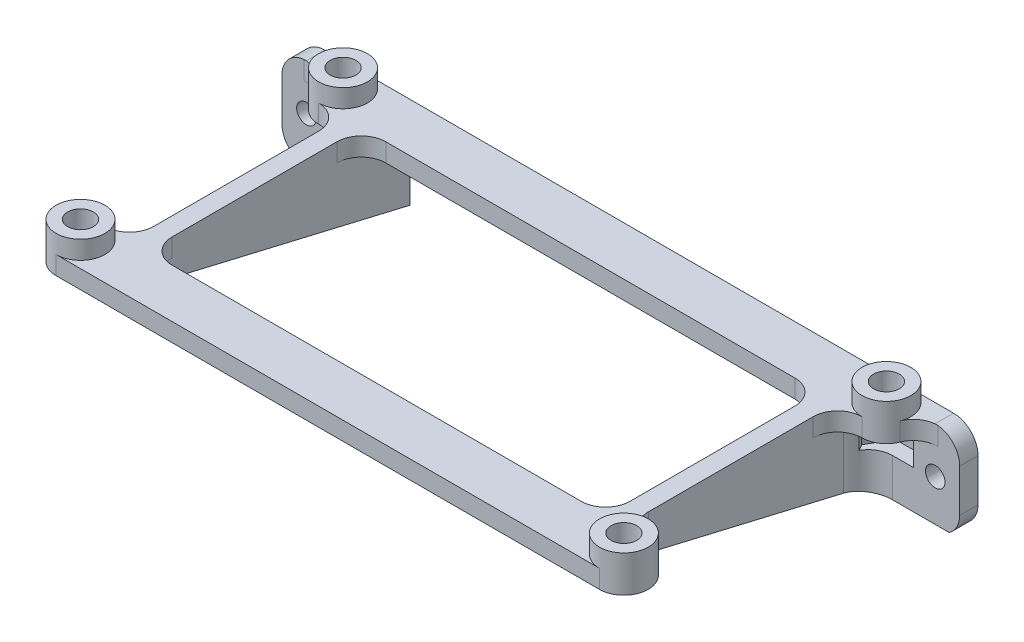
ISO-10303-21;
HEADER;
FILE_DESCRIPTION(('STEP AP214'),'2;1');
FILE_NAME('part.step','',(''),(''),'','','');
FILE_SCHEMA(('AUTOMOTIVE_DESIGN { 1 0 10303 214 1 1 1 1 }'));
ENDSEC;
DATA;
#1=APPLICATION_CONTEXT('core data for automotive mechanical design processes');
#2=APPLICATION_PROTOCOL_DEFINITION('international standard','automotive_design',2000,#1);
#3=PRODUCT_CONTEXT('',#1,'mechanical');
#4=PRODUCT('Part','Part','',(#3));
#5=PRODUCT_RELATED_PRODUCT_CATEGORY('part','',(#4));
#6=PRODUCT_DEFINITION_FORMATION('','',#4);
#7=PRODUCT_DEFINITION_CONTEXT('part definition',#1,'design');
#8=PRODUCT_DEFINITION('design','',#6,#7);
#9=PRODUCT_DEFINITION_SHAPE('','',#8);
#10=(LENGTH_UNIT() NAMED_UNIT(*) SI_UNIT(.MILLI.,.METRE.));
#11=(NAMED_UNIT(*) PLANE_ANGLE_UNIT() SI_UNIT($,.RADIAN.));
#12=(NAMED_UNIT(*) SI_UNIT($,.STERADIAN.) SOLID_ANGLE_UNIT());
#13=UNCERTAINTY_MEASURE_WITH_UNIT(LENGTH_MEASURE(1.E-05),#10,'distance_accuracy_value','');
#14=(GEOMETRIC_REPRESENTATION_CONTEXT(3) GLOBAL_UNCERTAINTY_ASSIGNED_CONTEXT((#13)) GLOBAL_UNIT_ASSIGNED_CONTEXT((#10,
#11,#12)) REPRESENTATION_CONTEXT('',''));
#15=CARTESIAN_POINT('',(0.,0.,0.));
#16=DIRECTION('',(0.,0.,1.));
#17=DIRECTION('',(1.,0.,0.));
#18=AXIS2_PLACEMENT_3D('',#15,#16,#17);
#19=CARTESIAN_POINT('',(89.,-3.,0.));
#20=DIRECTION('',(0.,1.,0.));
#21=DIRECTION('',(0.,0.,1.));
#22=AXIS2_PLACEMENT_3D('',#19,#20,#21);
#23=CYLINDRICAL_SURFACE('',#22,2.1);
#24=CARTESIAN_POINT('',(89.,3.,0.));
#25=DIRECTION('',(0.,1.,0.));
#26=DIRECTION('',(0.,0.,1.));
#27=AXIS2_PLACEMENT_3D('',#24,#25,#26);
#28=CIRCLE('',#27,2.1);
#29=CARTESIAN_POINT('',(89.,3.,2.1));
#30=VERTEX_POINT('',#29);
#31=EDGE_CURVE('E512',#30,#30,#28,.T.);
#32=ORIENTED_EDGE('',*,*,#31,.T.);
#33=EDGE_LOOP('',(#32));
#34=FACE_BOUND('',#33,.T.);
#35=CARTESIAN_POINT('',(89.,-3.,0.));
#36=DIRECTION('',(0.,1.,0.));
#37=DIRECTION('',(0.,0.,1.));
#38=AXIS2_PLACEMENT_3D('',#35,#36,#37);
#39=CIRCLE('',#38,2.1);
#40=CARTESIAN_POINT('',(89.,-3.,2.1));
#41=VERTEX_POINT('',#40);
#42=EDGE_CURVE('E526',#41,#41,#39,.T.);
#43=ORIENTED_EDGE('',*,*,#42,.F.);
#44=EDGE_LOOP('',(#43));
#45=FACE_BOUND('',#44,.T.);
#46=ADVANCED_FACE('F33',(#34,#45),#23,.F.);
#47=CARTESIAN_POINT('',(0.,3.,0.));
#48=DIRECTION('',(0.,-1.,0.));
#49=DIRECTION('',(0.,0.,-1.));
#50=AXIS2_PLACEMENT_3D('',#47,#48,#49);
#51=CYLINDRICAL_SURFACE('',#50,2.1);
#52=CARTESIAN_POINT('',(0.,3.,0.));
#53=DIRECTION('',(0.,1.,0.));
#54=DIRECTION('',(0.,0.,1.));
#55=AXIS2_PLACEMENT_3D('',#52,#53,#54);
#56=CIRCLE('',#55,2.1);
#57=CARTESIAN_POINT('',(0.,3.,2.1));
#58=VERTEX_POINT('',#57);
#59=EDGE_CURVE('E584',#58,#58,#56,.T.);
#60=ORIENTED_EDGE('',*,*,#59,.T.);
#61=EDGE_LOOP('',(#60));
#62=FACE_BOUND('',#61,.T.);
#63=CARTESIAN_POINT('',(0.,-3.,0.));
#64=DIRECTION('',(0.,1.,0.));
#65=DIRECTION('',(0.,0.,1.));
#66=AXIS2_PLACEMENT_3D('',#63,#64,#65);
#67=CIRCLE('',#66,2.1);
#68=CARTESIAN_POINT('',(0.,-3.,2.1));
#69=VERTEX_POINT('',#68);
#70=EDGE_CURVE('E529',#69,#69,#67,.T.);
#71=ORIENTED_EDGE('',*,*,#70,.F.);
#72=EDGE_LOOP('',(#71));
#73=FACE_BOUND('',#72,.T.);
#74=ADVANCED_FACE('F820',(#62,#73),#51,.F.);
#75=CARTESIAN_POINT('',(89.0000000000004,0.,-1.00000000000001));
#76=DIRECTION('',(0.,0.,-1.));
#77=DIRECTION('',(1.,0.,0.));
#78=AXIS2_PLACEMENT_3D('',#75,#76,#77);
#79=PLANE('',#78);
#80=CARTESIAN_POINT('',(-6.99999999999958,-7.5,-0.999999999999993));
#81=DIRECTION('',(0.,0.,1.));
#82=DIRECTION('',(1.,0.,0.));
#83=AXIS2_PLACEMENT_3D('',#80,#81,#82);
#84=CIRCLE('',#83,1.60000000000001);
#85=CARTESIAN_POINT('',(-5.39999999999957,-7.5,-0.999999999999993));
#86=VERTEX_POINT('',#85);
#87=EDGE_CURVE('E417',#86,#86,#84,.T.);
#88=ORIENTED_EDGE('',*,*,#87,.F.);
#89=EDGE_LOOP('',(#88));
#90=FACE_BOUND('',#89,.T.);
#91=DIRECTION('',(0.,-1.,0.));
#92=VECTOR('',#91,1.);
#93=CARTESIAN_POINT('',(-3.46410161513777,0.,-0.999999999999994));
#94=LINE('',#93,#92);
#95=CARTESIAN_POINT('',(-3.46410161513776,-3.,-0.999999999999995));
#96=VERTEX_POINT('',#95);
#97=CARTESIAN_POINT('',(-3.46410161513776,-8.,-0.999999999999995));
#98=VERTEX_POINT('',#97);
#99=EDGE_CURVE('E1042',#96,#98,#94,.T.);
#100=ORIENTED_EDGE('',*,*,#99,.F.);
#101=DIRECTION('',(-1.,0.,0.));
#102=VECTOR('',#101,1.);
#103=CARTESIAN_POINT('',(0.,-3.,-0.999999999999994));
#104=LINE('',#103,#102);
#105=CARTESIAN_POINT('',(-7.41619848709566,-3.,-0.999999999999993));
#106=VERTEX_POINT('',#105);
#107=EDGE_CURVE('E426',#96,#106,#104,.T.);
#108=ORIENTED_EDGE('',*,*,#107,.T.);
#109=DIRECTION('',(0.,1.,0.));
#110=VECTOR('',#109,1.);
#111=CARTESIAN_POINT('',(-7.41619848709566,0.,-0.999999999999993));
#112=LINE('',#111,#110);
#113=CARTESIAN_POINT('',(-7.41619848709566,-0.0217115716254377,-0.999999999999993));
#114=VERTEX_POINT('',#113);
#115=EDGE_CURVE('E714',#106,#114,#112,.T.);
#116=ORIENTED_EDGE('',*,*,#115,.T.);
#117=CARTESIAN_POINT('',(-6.99999999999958,-4.,-0.999999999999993));
#118=DIRECTION('',(0.,0.,-1.));
#119=DIRECTION('',(-1.,0.,0.));
#120=AXIS2_PLACEMENT_3D('',#117,#118,#119);
#121=CIRCLE('',#120,4.);
#122=CARTESIAN_POINT('',(-10.9999999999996,-4.,-0.999999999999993));
#123=VERTEX_POINT('',#122);
#124=EDGE_CURVE('E649',#114,#123,#121,.F.);
#125=ORIENTED_EDGE('',*,*,#124,.T.);
#126=DIRECTION('',(0.,-1.,0.));
#127=VECTOR('',#126,1.);
#128=CARTESIAN_POINT('',(-10.9999999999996,-15.,-0.999999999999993));
#129=LINE('',#128,#127);
#130=CARTESIAN_POINT('',(-10.9999999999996,-11.,-0.999999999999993));
#131=VERTEX_POINT('',#130);
#132=EDGE_CURVE('E423',#123,#131,#129,.T.);
#133=ORIENTED_EDGE('',*,*,#132,.T.);
#134=CARTESIAN_POINT('',(-6.99999999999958,-11.,-0.999999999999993));
#135=DIRECTION('',(0.,0.,-1.));
#136=DIRECTION('',(-1.,0.,0.));
#137=AXIS2_PLACEMENT_3D('',#134,#135,#136);
#138=CIRCLE('',#137,4.);
#139=CARTESIAN_POINT('',(-9.26909429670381,-14.2941176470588,-0.999999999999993));
#140=VERTEX_POINT('',#139);
#141=EDGE_CURVE('E646',#131,#140,#138,.F.);
#142=ORIENTED_EDGE('',*,*,#141,.T.);
#143=DIRECTION('',(-1.,0.,0.));
#144=VECTOR('',#143,1.);
#145=CARTESIAN_POINT('',(100.,-14.2941176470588,-1.));
#146=LINE('',#145,#144);
#147=CARTESIAN_POINT('',(0.,-14.2941176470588,-0.999999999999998));
#148=VERTEX_POINT('',#147);
#149=EDGE_CURVE('E411',#148,#140,#146,.T.);
#150=ORIENTED_EDGE('',*,*,#149,.F.);
#151=DIRECTION('',(0.,1.,0.));
#152=VECTOR('',#151,1.);
#153=CARTESIAN_POINT('',(0.,0.,-0.999999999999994));
#154=LINE('',#153,#152);
#155=CARTESIAN_POINT('',(0.,-8.,-0.999999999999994));
#156=VERTEX_POINT('',#155);
#157=EDGE_CURVE('E711',#148,#156,#154,.T.);
#158=ORIENTED_EDGE('',*,*,#157,.T.);
#159=DIRECTION('',(1.,0.,0.));
#160=VECTOR('',#159,1.);
#161=CARTESIAN_POINT('',(89.0000000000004,-8.,-1.00000000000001));
#162=LINE('',#161,#160);
#163=EDGE_CURVE('E56',#98,#156,#162,.T.);
#164=ORIENTED_EDGE('',*,*,#163,.F.);
#165=EDGE_LOOP('',(#100,#108,#116,#125,#133,#142,#150,#158,#164));
#166=FACE_BOUND('',#165,.T.);
#167=ADVANCED_FACE('F826',(#90,#166),#79,.F.);
#168=CARTESIAN_POINT('',(0.,0.,3.00000000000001));
#169=DIRECTION('',(0.,1.,0.));
#170=DIRECTION('',(0.,0.,1.));
#171=AXIS2_PLACEMENT_3D('',#168,#169,#170);
#172=CYLINDRICAL_SURFACE('',#171,4.);
#173=DIRECTION('',(0.,1.,0.));
#174=VECTOR('',#173,1.);
#175=CARTESIAN_POINT('',(3.46410161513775,0.,1.));
#176=LINE('',#175,#174);
#177=CARTESIAN_POINT('',(3.46410161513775,-8.,1.));
#178=VERTEX_POINT('',#177);
#179=CARTESIAN_POINT('',(3.46410161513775,-3.,1.));
#180=VERTEX_POINT('',#179);
#181=EDGE_CURVE('E1040',#178,#180,#176,.T.);
#182=ORIENTED_EDGE('',*,*,#181,.F.);
#183=CARTESIAN_POINT('',(0.,-8.,3.00000000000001));
#184=DIRECTION('',(0.,1.,0.));
#185=DIRECTION('',(0.,0.,1.));
#186=AXIS2_PLACEMENT_3D('',#183,#184,#185);
#187=CIRCLE('',#186,4.);
#188=EDGE_CURVE('E1034',#156,#178,#187,.F.);
#189=ORIENTED_EDGE('',*,*,#188,.F.);
#190=ORIENTED_EDGE('',*,*,#157,.F.);
#191=CARTESIAN_POINT('',(0.,-13.3529411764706,3.00000000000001));
#192=DIRECTION('',(0.,-0.973417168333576,0.229039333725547));
#193=DIRECTION('',(0.,0.229039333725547,0.973417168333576));
#194=AXIS2_PLACEMENT_3D('',#191,#192,#193);
#195=ELLIPSE('',#194,4.109235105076,4.);
#196=CARTESIAN_POINT('',(4.,-13.3529411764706,3.));
#197=VERTEX_POINT('',#196);
#198=EDGE_CURVE('E1033',#197,#148,#195,.F.);
#199=ORIENTED_EDGE('',*,*,#198,.F.);
#200=DIRECTION('',(0.,1.,0.));
#201=VECTOR('',#200,1.);
#202=CARTESIAN_POINT('',(4.,-3.,3.00000000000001));
#203=LINE('',#202,#201);
#204=CARTESIAN_POINT('',(4.,-3.,3.00000000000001));
#205=VERTEX_POINT('',#204);
#206=EDGE_CURVE('E692',#205,#197,#203,.F.);
#207=ORIENTED_EDGE('',*,*,#206,.F.);
#208=CARTESIAN_POINT('',(0.,-3.,3.00000000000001));
#209=DIRECTION('',(0.,1.,0.));
#210=DIRECTION('',(0.,0.,1.));
#211=AXIS2_PLACEMENT_3D('',#208,#209,#210);
#212=CIRCLE('',#211,4.);
#213=EDGE_CURVE('E719',#180,#205,#212,.F.);
#214=ORIENTED_EDGE('',*,*,#213,.F.);
#215=EDGE_LOOP('',(#182,#189,#190,#199,#207,#214));
#216=FACE_BOUND('',#215,.T.);
#217=ADVANCED_FACE('F35',(#216),#172,.F.);
#218=CARTESIAN_POINT('',(0.,-3.,0.));
#219=DIRECTION('',(0.,1.,0.));
#220=DIRECTION('',(0.,0.,1.));
#221=AXIS2_PLACEMENT_3D('',#218,#219,#220);
#222=PLANE('',#221);
#223=CARTESIAN_POINT('',(0.,-3.,8.));
#224=DIRECTION('',(0.,1.,0.));
#225=DIRECTION('',(0.,0.,1.));
#226=AXIS2_PLACEMENT_3D('',#223,#224,#225);
#227=CIRCLE('',#226,4.);
#228=CARTESIAN_POINT('',(4.,-3.,8.));
#229=VERTEX_POINT('',#228);
#230=CARTESIAN_POINT('',(0.,-3.,4.));
#231=VERTEX_POINT('',#230);
#232=EDGE_CURVE('E755',#229,#231,#227,.T.);
#233=ORIENTED_EDGE('',*,*,#232,.T.);
#234=CARTESIAN_POINT('',(0.,-3.,0.));
#235=DIRECTION('',(0.,1.,0.));
#236=DIRECTION('',(0.,0.,1.));
#237=AXIS2_PLACEMENT_3D('',#234,#235,#236);
#238=CIRCLE('',#237,4.);
#239=CARTESIAN_POINT('',(-3.70809924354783,-3.,1.5));
#240=VERTEX_POINT('',#239);
#241=EDGE_CURVE('E548',#240,#231,#238,.T.);
#242=ORIENTED_EDGE('',*,*,#241,.F.);
#243=CARTESIAN_POINT('',(-7.41619848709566,-3.,3.00000000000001));
#244=DIRECTION('',(0.,1.,0.));
#245=DIRECTION('',(0.,0.,1.));
#246=AXIS2_PLACEMENT_3D('',#243,#244,#245);
#247=CIRCLE('',#246,4.);
#248=EDGE_CURVE('E1031',#240,#106,#247,.T.);
#249=ORIENTED_EDGE('',*,*,#248,.T.);
#250=ORIENTED_EDGE('',*,*,#107,.F.);
#251=DIRECTION('',(0.5,0.,-0.866025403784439));
#252=VECTOR('',#251,1.);
#253=CARTESIAN_POINT('',(-4.04145188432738,-3.,0.));
#254=LINE('',#253,#252);
#255=CARTESIAN_POINT('',(-2.02072594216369,-3.,-3.5));
#256=VERTEX_POINT('',#255);
#257=EDGE_CURVE('E354',#96,#256,#254,.T.);
#258=ORIENTED_EDGE('',*,*,#257,.T.);
#259=DIRECTION('',(1.,0.,0.));
#260=VECTOR('',#259,1.);
#261=CARTESIAN_POINT('',(-2.02072594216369,-3.,-3.5));
#262=LINE('',#261,#260);
#263=CARTESIAN_POINT('',(2.02072594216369,-3.,-3.5));
#264=VERTEX_POINT('',#263);
#265=EDGE_CURVE('E395',#256,#264,#262,.T.);
#266=ORIENTED_EDGE('',*,*,#265,.T.);
#267=DIRECTION('',(0.5,0.,0.866025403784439));
#268=VECTOR('',#267,1.);
#269=CARTESIAN_POINT('',(2.02072594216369,-3.,-3.5));
#270=LINE('',#269,#268);
#271=CARTESIAN_POINT('',(4.04145188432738,-3.,0.));
#272=VERTEX_POINT('',#271);
#273=EDGE_CURVE('E397',#264,#272,#270,.T.);
#274=ORIENTED_EDGE('',*,*,#273,.T.);
#275=DIRECTION('',(-0.5,0.,0.866025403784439));
#276=VECTOR('',#275,1.);
#277=CARTESIAN_POINT('',(4.04145188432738,-3.,0.));
#278=LINE('',#277,#276);
#279=EDGE_CURVE('E48',#272,#180,#278,.T.);
#280=ORIENTED_EDGE('',*,*,#279,.T.);
#281=ORIENTED_EDGE('',*,*,#213,.T.);
#282=DIRECTION('',(0.,0.,-1.));
#283=VECTOR('',#282,1.);
#284=CARTESIAN_POINT('',(4.,-3.,-4.));
#285=LINE('',#284,#283);
#286=EDGE_CURVE('E620',#229,#205,#285,.T.);
#287=ORIENTED_EDGE('',*,*,#286,.F.);
#288=EDGE_LOOP('',(#233,#242,#249,#250,#258,#266,#274,#280,#281,#287));
#289=FACE_BOUND('',#288,.T.);
#290=ORIENTED_EDGE('',*,*,#70,.T.);
#291=EDGE_LOOP('',(#290));
#292=FACE_BOUND('',#291,.T.);
#293=ADVANCED_FACE('F859',(#289,#292),#222,.F.);
#294=CARTESIAN_POINT('',(0.,3.,0.));
#295=DIRECTION('',(0.,-1.,0.));
#296=DIRECTION('',(0.,0.,-1.));
#297=AXIS2_PLACEMENT_3D('',#294,#295,#296);
#298=CYLINDRICAL_SURFACE('',#297,4.);
#299=CARTESIAN_POINT('',(0.,3.,0.));
#300=DIRECTION('',(0.,1.,0.));
#301=DIRECTION('',(0.,0.,1.));
#302=AXIS2_PLACEMENT_3D('',#299,#300,#301);
#303=CIRCLE('',#302,4.);
#304=CARTESIAN_POINT('',(0.,3.,4.));
#305=VERTEX_POINT('',#304);
#306=EDGE_CURVE('E583',#305,#305,#303,.T.);
#307=ORIENTED_EDGE('',*,*,#306,.F.);
#308=EDGE_LOOP('',(#307));
#309=FACE_BOUND('',#308,.T.);
#310=CARTESIAN_POINT('',(0.,0.,0.));
#311=DIRECTION('',(0.,-1.,0.));
#312=DIRECTION('',(1.,0.,0.));
#313=AXIS2_PLACEMENT_3D('',#310,#311,#312);
#314=CIRCLE('',#313,4.);
#315=CARTESIAN_POINT('',(-3.70809924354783,0.,1.5));
#316=VERTEX_POINT('',#315);
#317=CARTESIAN_POINT('',(0.,0.,-4.));
#318=VERTEX_POINT('',#317);
#319=EDGE_CURVE('E435',#316,#318,#314,.T.);
#320=ORIENTED_EDGE('',*,*,#319,.F.);
#321=DIRECTION('',(0.,-1.,0.));
#322=VECTOR('',#321,1.);
#323=CARTESIAN_POINT('',(-3.70809924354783,3.,1.5));
#324=LINE('',#323,#322);
#325=EDGE_CURVE('E717',#316,#240,#324,.T.);
#326=ORIENTED_EDGE('',*,*,#325,.T.);
#327=ORIENTED_EDGE('',*,*,#241,.T.);
#328=DIRECTION('',(0.,1.,0.));
#329=VECTOR('',#328,1.);
#330=CARTESIAN_POINT('',(0.,-3.,4.));
#331=LINE('',#330,#329);
#332=CARTESIAN_POINT('',(0.,0.,4.));
#333=VERTEX_POINT('',#332);
#334=EDGE_CURVE('E574',#231,#333,#331,.T.);
#335=ORIENTED_EDGE('',*,*,#334,.T.);
#336=CARTESIAN_POINT('',(0.,0.,0.));
#337=DIRECTION('',(0.,1.,0.));
#338=DIRECTION('',(0.,0.,1.));
#339=AXIS2_PLACEMENT_3D('',#336,#337,#338);
#340=CIRCLE('',#339,4.);
#341=EDGE_CURVE('E581',#333,#318,#340,.T.);
#342=ORIENTED_EDGE('',*,*,#341,.T.);
#343=EDGE_LOOP('',(#320,#326,#327,#335,#342));
#344=FACE_BOUND('',#343,.T.);
#345=ADVANCED_FACE('F784',(#309,#344),#298,.T.);
#346=CARTESIAN_POINT('',(4.,-3.,4.));
#347=DIRECTION('',(-1.,0.,0.));
#348=DIRECTION('',(0.,0.,1.));
#349=AXIS2_PLACEMENT_3D('',#346,#347,#348);
#350=PLANE('',#349);
#351=CARTESIAN_POINT('',(4.00000000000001,-3.,47.));
#352=VERTEX_POINT('',#351);
#353=CARTESIAN_POINT('',(4.,-3.,35.));
#354=VERTEX_POINT('',#353);
#355=EDGE_CURVE('E494',#352,#354,#285,.T.);
#356=ORIENTED_EDGE('',*,*,#355,.T.);
#357=DIRECTION('',(0.,1.,0.));
#358=VECTOR('',#357,1.);
#359=CARTESIAN_POINT('',(4.,0.,35.));
#360=LINE('',#359,#358);
#361=CARTESIAN_POINT('',(4.,0.,35.));
#362=VERTEX_POINT('',#361);
#363=EDGE_CURVE('E697',#354,#362,#360,.T.);
#364=ORIENTED_EDGE('',*,*,#363,.T.);
#365=DIRECTION('',(0.,0.,1.));
#366=VECTOR('',#365,1.);
#367=CARTESIAN_POINT('',(4.,0.,4.));
#368=LINE('',#367,#366);
#369=CARTESIAN_POINT('',(4.,0.,8.));
#370=VERTEX_POINT('',#369);
#371=EDGE_CURVE('E607',#370,#362,#368,.T.);
#372=ORIENTED_EDGE('',*,*,#371,.F.);
#373=DIRECTION('',(0.,1.,0.));
#374=VECTOR('',#373,1.);
#375=CARTESIAN_POINT('',(4.,-3.,8.));
#376=LINE('',#375,#374);
#377=EDGE_CURVE('E694',#370,#229,#376,.F.);
#378=ORIENTED_EDGE('',*,*,#377,.T.);
#379=ORIENTED_EDGE('',*,*,#286,.T.);
#380=ORIENTED_EDGE('',*,*,#206,.T.);
#381=DIRECTION('',(0.,0.229039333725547,0.973417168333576));
#382=VECTOR('',#381,1.);
#383=CARTESIAN_POINT('',(4.00000000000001,-3.,47.));
#384=LINE('',#383,#382);
#385=EDGE_CURVE('E476',#197,#352,#384,.T.);
#386=ORIENTED_EDGE('',*,*,#385,.T.);
#387=EDGE_LOOP('',(#356,#364,#372,#378,#379,#380,#386));
#388=FACE_BOUND('',#387,.T.);
#389=ADVANCED_FACE('F891',(#388),#350,.T.);
#390=CARTESIAN_POINT('',(96.4161984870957,-3.,3.));
#391=DIRECTION('',(0.,1.,0.));
#392=DIRECTION('',(0.,0.,1.));
#393=AXIS2_PLACEMENT_3D('',#390,#391,#392);
#394=CIRCLE('',#393,4.);
#395=CARTESIAN_POINT('',(96.4161984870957,-3.,-1.));
#396=VERTEX_POINT('',#395);
#397=CARTESIAN_POINT('',(92.7080992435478,-3.,1.5));
#398=VERTEX_POINT('',#397);
#399=EDGE_CURVE('E770',#396,#398,#394,.T.);
#400=ORIENTED_EDGE('',*,*,#399,.T.);
#401=CARTESIAN_POINT('',(89.,-3.,0.));
#402=DIRECTION('',(0.,1.,0.));
#403=DIRECTION('',(0.,0.,1.));
#404=AXIS2_PLACEMENT_3D('',#401,#402,#403);
#405=CIRCLE('',#404,4.);
#406=CARTESIAN_POINT('',(89.,-3.,4.));
#407=VERTEX_POINT('',#406);
#408=EDGE_CURVE('E612',#407,#398,#405,.T.);
#409=ORIENTED_EDGE('',*,*,#408,.F.);
#410=CARTESIAN_POINT('',(89.0000000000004,-3.,8.));
#411=DIRECTION('',(0.,1.,0.));
#412=DIRECTION('',(0.,0.,1.));
#413=AXIS2_PLACEMENT_3D('',#410,#411,#412);
#414=CIRCLE('',#413,4.);
#415=CARTESIAN_POINT('',(85.0000000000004,-3.,8.));
#416=VERTEX_POINT('',#415);
#417=EDGE_CURVE('E723',#407,#416,#414,.T.);
#418=ORIENTED_EDGE('',*,*,#417,.T.);
#419=DIRECTION('',(0.,0.,-1.));
#420=VECTOR('',#419,1.);
#421=CARTESIAN_POINT('',(85.0000000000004,-3.,-4.00000000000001));
#422=LINE('',#421,#420);
#423=CARTESIAN_POINT('',(85.0000000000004,-3.,3.));
#424=VERTEX_POINT('',#423);
#425=EDGE_CURVE('E460',#416,#424,#422,.T.);
#426=ORIENTED_EDGE('',*,*,#425,.T.);
#427=CARTESIAN_POINT('',(89.0000000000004,-3.,3.));
#428=DIRECTION('',(0.,1.,0.));
#429=DIRECTION('',(0.,0.,1.));
#430=AXIS2_PLACEMENT_3D('',#427,#428,#429);
#431=CIRCLE('',#430,4.);
#432=CARTESIAN_POINT('',(85.5358983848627,-3.,0.999999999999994));
#433=VERTEX_POINT('',#432);
#434=EDGE_CURVE('E708',#424,#433,#431,.F.);
#435=ORIENTED_EDGE('',*,*,#434,.T.);
#436=DIRECTION('',(0.5,0.,0.866025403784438));
#437=VECTOR('',#436,1.);
#438=CARTESIAN_POINT('',(84.9585481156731,-3.,0.));
#439=LINE('',#438,#437);
#440=CARTESIAN_POINT('',(84.9585481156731,-3.,0.));
#441=VERTEX_POINT('',#440);
#442=EDGE_CURVE('E374',#441,#433,#439,.T.);
#443=ORIENTED_EDGE('',*,*,#442,.F.);
#444=DIRECTION('',(-0.5,0.,0.866025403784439));
#445=VECTOR('',#444,1.);
#446=CARTESIAN_POINT('',(86.9792740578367,-3.,-3.50000000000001));
#447=LINE('',#446,#445);
#448=CARTESIAN_POINT('',(86.9792740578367,-3.,-3.50000000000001));
#449=VERTEX_POINT('',#448);
#450=EDGE_CURVE('E351',#449,#441,#447,.T.);
#451=ORIENTED_EDGE('',*,*,#450,.F.);
#452=DIRECTION('',(-1.,0.,0.));
#453=VECTOR('',#452,1.);
#454=CARTESIAN_POINT('',(91.0207259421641,-3.,-3.50000000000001));
#455=LINE('',#454,#453);
#456=CARTESIAN_POINT('',(91.0207259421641,-3.,-3.50000000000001));
#457=VERTEX_POINT('',#456);
#458=EDGE_CURVE('E377',#457,#449,#455,.T.);
#459=ORIENTED_EDGE('',*,*,#458,.F.);
#460=DIRECTION('',(-0.5,0.,-0.866025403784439));
#461=VECTOR('',#460,1.);
#462=CARTESIAN_POINT('',(93.0414518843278,-3.,0.));
#463=LINE('',#462,#461);
#464=CARTESIAN_POINT('',(92.4641016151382,-3.,-1.));
#465=VERTEX_POINT('',#464);
#466=EDGE_CURVE('E363',#465,#457,#463,.T.);
#467=ORIENTED_EDGE('',*,*,#466,.F.);
#468=DIRECTION('',(-1.,0.,0.));
#469=VECTOR('',#468,1.);
#470=CARTESIAN_POINT('',(0.,-3.,-1.));
#471=LINE('',#470,#469);
#472=EDGE_CURVE('E450',#396,#465,#471,.T.);
#473=ORIENTED_EDGE('',*,*,#472,.F.);
#474=EDGE_LOOP('',(#400,#409,#418,#426,#435,#443,#451,#459,#467,#473));
#475=FACE_BOUND('',#474,.T.);
#476=ORIENTED_EDGE('',*,*,#42,.T.);
#477=EDGE_LOOP('',(#476));
#478=FACE_BOUND('',#477,.T.);
#479=ADVANCED_FACE('F879',(#475,#478),#222,.F.);
#480=CARTESIAN_POINT('',(85.0000000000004,-3.,4.));
#481=DIRECTION('',(1.,0.,0.));
#482=DIRECTION('',(0.,0.,-1.));
#483=AXIS2_PLACEMENT_3D('',#480,#481,#482);
#484=PLANE('',#483);
#485=ORIENTED_EDGE('',*,*,#425,.F.);
#486=DIRECTION('',(0.,1.,0.));
#487=VECTOR('',#486,1.);
#488=CARTESIAN_POINT('',(85.0000000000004,0.,8.));
#489=LINE('',#488,#487);
#490=CARTESIAN_POINT('',(85.0000000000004,0.,8.));
#491=VERTEX_POINT('',#490);
#492=EDGE_CURVE('E660',#416,#491,#489,.T.);
#493=ORIENTED_EDGE('',*,*,#492,.T.);
#494=DIRECTION('',(0.,0.,-1.));
#495=VECTOR('',#494,1.);
#496=CARTESIAN_POINT('',(85.0000000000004,0.,4.));
#497=LINE('',#496,#495);
#498=CARTESIAN_POINT('',(85.0000000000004,0.,35.));
#499=VERTEX_POINT('',#498);
#500=EDGE_CURVE('E571',#499,#491,#497,.T.);
#501=ORIENTED_EDGE('',*,*,#500,.F.);
#502=DIRECTION('',(0.,1.,0.));
#503=VECTOR('',#502,1.);
#504=CARTESIAN_POINT('',(85.0000000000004,-3.,35.));
#505=LINE('',#504,#503);
#506=CARTESIAN_POINT('',(85.0000000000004,-3.,35.));
#507=VERTEX_POINT('',#506);
#508=EDGE_CURVE('E657',#499,#507,#505,.F.);
#509=ORIENTED_EDGE('',*,*,#508,.T.);
#510=CARTESIAN_POINT('',(85.0000000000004,-3.,47.));
#511=VERTEX_POINT('',#510);
#512=EDGE_CURVE('E471',#511,#507,#422,.T.);
#513=ORIENTED_EDGE('',*,*,#512,.F.);
#514=DIRECTION('',(0.,0.229039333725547,0.973417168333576));
#515=VECTOR('',#514,1.);
#516=CARTESIAN_POINT('',(85.0000000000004,-3.,47.));
#517=LINE('',#516,#515);
#518=CARTESIAN_POINT('',(85.0000000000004,-13.3529411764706,3.));
#519=VERTEX_POINT('',#518);
#520=EDGE_CURVE('E465',#519,#511,#517,.T.);
#521=ORIENTED_EDGE('',*,*,#520,.F.);
#522=DIRECTION('',(0.,1.,0.));
#523=VECTOR('',#522,1.);
#524=CARTESIAN_POINT('',(85.0000000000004,-3.,3.));
#525=LINE('',#524,#523);
#526=EDGE_CURVE('E654',#519,#424,#525,.T.);
#527=ORIENTED_EDGE('',*,*,#526,.T.);
#528=EDGE_LOOP('',(#485,#493,#501,#509,#513,#521,#527));
#529=FACE_BOUND('',#528,.T.);
#530=ADVANCED_FACE('F875',(#529),#484,.T.);
#531=DIRECTION('',(-1.,0.,0.));
#532=VECTOR('',#531,1.);
#533=CARTESIAN_POINT('',(0.,-3.,-4.));
#534=LINE('',#533,#532);
#535=CARTESIAN_POINT('',(82.0000000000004,-3.,-4.));
#536=VERTEX_POINT('',#535);
#537=CARTESIAN_POINT('',(7.,-3.,-4.));
#538=VERTEX_POINT('',#537);
#539=EDGE_CURVE('E578',#536,#538,#534,.T.);
#540=ORIENTED_EDGE('',*,*,#539,.F.);
#541=DIRECTION('',(0.,0.,-1.));
#542=VECTOR('',#541,1.);
#543=CARTESIAN_POINT('',(82.0000000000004,-3.,-4.00000000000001));
#544=LINE('',#543,#542);
#545=CARTESIAN_POINT('',(82.0000000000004,-3.,8.));
#546=VERTEX_POINT('',#545);
#547=EDGE_CURVE('E464',#546,#536,#544,.T.);
#548=ORIENTED_EDGE('',*,*,#547,.F.);
#549=CARTESIAN_POINT('',(78.0000000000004,-3.,8.));
#550=DIRECTION('',(0.,1.,0.));
#551=DIRECTION('',(0.,0.,1.));
#552=AXIS2_PLACEMENT_3D('',#549,#550,#551);
#553=CIRCLE('',#552,4.);
#554=CARTESIAN_POINT('',(78.0000000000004,-3.,4.));
#555=VERTEX_POINT('',#554);
#556=EDGE_CURVE('E737',#546,#555,#553,.T.);
#557=ORIENTED_EDGE('',*,*,#556,.T.);
#558=DIRECTION('',(-1.,0.,0.));
#559=VECTOR('',#558,1.);
#560=CARTESIAN_POINT('',(7.,-3.,4.));
#561=LINE('',#560,#559);
#562=CARTESIAN_POINT('',(11.,-3.,4.));
#563=VERTEX_POINT('',#562);
#564=EDGE_CURVE('E610',#555,#563,#561,.T.);
#565=ORIENTED_EDGE('',*,*,#564,.T.);
#566=CARTESIAN_POINT('',(11.,-3.,8.));
#567=DIRECTION('',(0.,1.,0.));
#568=DIRECTION('',(0.,0.,1.));
#569=AXIS2_PLACEMENT_3D('',#566,#567,#568);
#570=CIRCLE('',#569,4.);
#571=CARTESIAN_POINT('',(7.,-3.,8.));
#572=VERTEX_POINT('',#571);
#573=EDGE_CURVE('E745',#563,#572,#570,.T.);
#574=ORIENTED_EDGE('',*,*,#573,.T.);
#575=DIRECTION('',(0.,0.,-1.));
#576=VECTOR('',#575,1.);
#577=CARTESIAN_POINT('',(7.,-3.,-4.));
#578=LINE('',#577,#576);
#579=EDGE_CURVE('E485',#572,#538,#578,.T.);
#580=ORIENTED_EDGE('',*,*,#579,.T.);
#581=EDGE_LOOP('',(#540,#548,#557,#565,#574,#580));
#582=FACE_BOUND('',#581,.T.);
#583=ADVANCED_FACE('F878',(#582),#222,.F.);
#584=CARTESIAN_POINT('',(89.0000000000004,-3.,43.));
#585=DIRECTION('',(0.,1.,0.));
#586=DIRECTION('',(0.,0.,1.));
#587=AXIS2_PLACEMENT_3D('',#584,#585,#586);
#588=CIRCLE('',#587,2.1);
#589=CARTESIAN_POINT('',(89.0000000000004,-3.,45.1));
#590=VERTEX_POINT('',#589);
#591=EDGE_CURVE('E521',#590,#590,#588,.T.);
#592=ORIENTED_EDGE('',*,*,#591,.T.);
#593=EDGE_LOOP('',(#592));
#594=FACE_BOUND('',#593,.T.);
#595=ORIENTED_EDGE('',*,*,#512,.T.);
#596=CARTESIAN_POINT('',(89.0000000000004,-3.,35.));
#597=DIRECTION('',(0.,1.,0.));
#598=DIRECTION('',(0.,0.,1.));
#599=AXIS2_PLACEMENT_3D('',#596,#597,#598);
#600=CIRCLE('',#599,4.);
#601=CARTESIAN_POINT('',(89.0000000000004,-3.,39.));
#602=VERTEX_POINT('',#601);
#603=EDGE_CURVE('E728',#507,#602,#600,.T.);
#604=ORIENTED_EDGE('',*,*,#603,.T.);
#605=CARTESIAN_POINT('',(89.0000000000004,-3.,43.));
#606=DIRECTION('',(0.,1.,0.));
#607=DIRECTION('',(0.,0.,1.));
#608=AXIS2_PLACEMENT_3D('',#605,#606,#607);
#609=CIRCLE('',#608,4.);
#610=CARTESIAN_POINT('',(89.0000000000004,-3.,47.));
#611=VERTEX_POINT('',#610);
#612=EDGE_CURVE('E557',#611,#602,#609,.T.);
#613=ORIENTED_EDGE('',*,*,#612,.F.);
#614=DIRECTION('',(1.,0.,0.));
#615=VECTOR('',#614,1.);
#616=CARTESIAN_POINT('',(4.50401092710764E-13,-3.,47.));
#617=LINE('',#616,#615);
#618=EDGE_CURVE('E554',#511,#611,#617,.T.);
#619=ORIENTED_EDGE('',*,*,#618,.F.);
#620=EDGE_LOOP('',(#595,#604,#613,#619));
#621=FACE_BOUND('',#620,.T.);
#622=ADVANCED_FACE('F918',(#594,#621),#222,.F.);
#623=CARTESIAN_POINT('',(4.50401092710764E-13,-3.,43.));
#624=DIRECTION('',(0.,1.,0.));
#625=DIRECTION('',(0.,0.,1.));
#626=AXIS2_PLACEMENT_3D('',#623,#624,#625);
#627=CIRCLE('',#626,2.1);
#628=CARTESIAN_POINT('',(4.50401092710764E-13,-3.,45.1));
#629=VERTEX_POINT('',#628);
#630=EDGE_CURVE('E532',#629,#629,#627,.T.);
#631=ORIENTED_EDGE('',*,*,#630,.T.);
#632=EDGE_LOOP('',(#631));
#633=FACE_BOUND('',#632,.T.);
#634=ORIENTED_EDGE('',*,*,#355,.F.);
#635=CARTESIAN_POINT('',(4.50401092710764E-13,-3.,47.));
#636=VERTEX_POINT('',#635);
#637=EDGE_CURVE('E564',#636,#352,#617,.T.);
#638=ORIENTED_EDGE('',*,*,#637,.F.);
#639=CARTESIAN_POINT('',(4.50401092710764E-13,-3.,43.));
#640=DIRECTION('',(0.,1.,0.));
#641=DIRECTION('',(0.,0.,1.));
#642=AXIS2_PLACEMENT_3D('',#639,#640,#641);
#643=CIRCLE('',#642,4.);
#644=CARTESIAN_POINT('',(4.50401092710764E-13,-3.,39.));
#645=VERTEX_POINT('',#644);
#646=EDGE_CURVE('E550',#645,#636,#643,.T.);
#647=ORIENTED_EDGE('',*,*,#646,.F.);
#648=CARTESIAN_POINT('',(0.,-3.,35.));
#649=DIRECTION('',(0.,1.,0.));
#650=DIRECTION('',(0.,0.,1.));
#651=AXIS2_PLACEMENT_3D('',#648,#649,#650);
#652=CIRCLE('',#651,4.);
#653=EDGE_CURVE('E750',#645,#354,#652,.T.);
#654=ORIENTED_EDGE('',*,*,#653,.T.);
#655=EDGE_LOOP('',(#634,#638,#647,#654));
#656=FACE_BOUND('',#655,.T.);
#657=ADVANCED_FACE('F860',(#633,#656),#222,.F.);
#658=CARTESIAN_POINT('',(0.,0.,0.));
#659=DIRECTION('',(0.,1.,0.));
#660=DIRECTION('',(0.,0.,1.));
#661=AXIS2_PLACEMENT_3D('',#658,#659,#660);
#662=PLANE('',#661);
#663=DIRECTION('',(-1.,0.,0.));
#664=VECTOR('',#663,1.);
#665=CARTESIAN_POINT('',(0.,0.,-4.));
#666=LINE('',#665,#664);
#667=CARTESIAN_POINT('',(89.,0.,-4.));
#668=VERTEX_POINT('',#667);
#669=EDGE_CURVE('E551',#668,#318,#666,.T.);
#670=ORIENTED_EDGE('',*,*,#669,.T.);
#671=ORIENTED_EDGE('',*,*,#341,.F.);
#672=CARTESIAN_POINT('',(0.,0.,8.));
#673=DIRECTION('',(0.,1.,0.));
#674=DIRECTION('',(0.,0.,1.));
#675=AXIS2_PLACEMENT_3D('',#672,#673,#674);
#676=CIRCLE('',#675,4.);
#677=EDGE_CURVE('E753',#333,#370,#676,.F.);
#678=ORIENTED_EDGE('',*,*,#677,.T.);
#679=ORIENTED_EDGE('',*,*,#371,.T.);
#680=CARTESIAN_POINT('',(0.,0.,35.));
#681=DIRECTION('',(0.,1.,0.));
#682=DIRECTION('',(0.,0.,1.));
#683=AXIS2_PLACEMENT_3D('',#680,#681,#682);
#684=CIRCLE('',#683,4.);
#685=CARTESIAN_POINT('',(4.50401092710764E-13,0.,39.));
#686=VERTEX_POINT('',#685);
#687=EDGE_CURVE('E748',#362,#686,#684,.F.);
#688=ORIENTED_EDGE('',*,*,#687,.T.);
#689=CARTESIAN_POINT('',(4.50401092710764E-13,0.,43.));
#690=DIRECTION('',(0.,1.,0.));
#691=DIRECTION('',(0.,0.,1.));
#692=AXIS2_PLACEMENT_3D('',#689,#690,#691);
#693=CIRCLE('',#692,4.);
#694=CARTESIAN_POINT('',(4.50401092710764E-13,0.,47.));
#695=VERTEX_POINT('',#694);
#696=EDGE_CURVE('E498',#695,#686,#693,.T.);
#697=ORIENTED_EDGE('',*,*,#696,.F.);
#698=DIRECTION('',(1.,0.,0.));
#699=VECTOR('',#698,1.);
#700=CARTESIAN_POINT('',(4.50401092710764E-13,0.,47.));
#701=LINE('',#700,#699);
#702=CARTESIAN_POINT('',(89.0000000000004,0.,47.));
#703=VERTEX_POINT('',#702);
#704=EDGE_CURVE('E604',#695,#703,#701,.T.);
#705=ORIENTED_EDGE('',*,*,#704,.T.);
#706=CARTESIAN_POINT('',(89.0000000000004,0.,43.));
#707=DIRECTION('',(0.,1.,0.));
#708=DIRECTION('',(0.,0.,1.));
#709=AXIS2_PLACEMENT_3D('',#706,#707,#708);
#710=CIRCLE('',#709,4.00000000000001);
#711=CARTESIAN_POINT('',(89.0000000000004,0.,39.));
#712=VERTEX_POINT('',#711);
#713=EDGE_CURVE('E508',#712,#703,#710,.T.);
#714=ORIENTED_EDGE('',*,*,#713,.F.);
#715=CARTESIAN_POINT('',(89.0000000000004,0.,35.));
#716=DIRECTION('',(0.,1.,0.));
#717=DIRECTION('',(0.,0.,1.));
#718=AXIS2_PLACEMENT_3D('',#715,#716,#717);
#719=CIRCLE('',#718,4.);
#720=EDGE_CURVE('E726',#712,#499,#719,.F.);
#721=ORIENTED_EDGE('',*,*,#720,.T.);
#722=ORIENTED_EDGE('',*,*,#500,.T.);
#723=CARTESIAN_POINT('',(89.0000000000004,0.,8.));
#724=DIRECTION('',(0.,1.,0.));
#725=DIRECTION('',(0.,0.,1.));
#726=AXIS2_PLACEMENT_3D('',#723,#724,#725);
#727=CIRCLE('',#726,4.);
#728=CARTESIAN_POINT('',(89.,0.,4.));
#729=VERTEX_POINT('',#728);
#730=EDGE_CURVE('E721',#491,#729,#727,.F.);
#731=ORIENTED_EDGE('',*,*,#730,.T.);
#732=CARTESIAN_POINT('',(89.,0.,0.));
#733=DIRECTION('',(0.,1.,0.));
#734=DIRECTION('',(0.,0.,1.));
#735=AXIS2_PLACEMENT_3D('',#732,#733,#734);
#736=CIRCLE('',#735,4.00000000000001);
#737=EDGE_CURVE('E517',#668,#729,#736,.T.);
#738=ORIENTED_EDGE('',*,*,#737,.F.);
#739=EDGE_LOOP('',(#670,#671,#678,#679,#688,#697,#705,#714,#721,#722,#731,#738));
#740=FACE_BOUND('',#739,.T.);
#741=DIRECTION('',(0.,0.,1.));
#742=VECTOR('',#741,1.);
#743=CARTESIAN_POINT('',(7.,0.,4.));
#744=LINE('',#743,#742);
#745=CARTESIAN_POINT('',(7.,0.,8.));
#746=VERTEX_POINT('',#745);
#747=CARTESIAN_POINT('',(7.,0.,35.));
#748=VERTEX_POINT('',#747);
#749=EDGE_CURVE('E535',#746,#748,#744,.T.);
#750=ORIENTED_EDGE('',*,*,#749,.F.);
#751=CARTESIAN_POINT('',(11.,0.,8.));
#752=DIRECTION('',(0.,1.,0.));
#753=DIRECTION('',(0.,0.,1.));
#754=AXIS2_PLACEMENT_3D('',#751,#752,#753);
#755=CIRCLE('',#754,4.);
#756=CARTESIAN_POINT('',(11.,0.,4.));
#757=VERTEX_POINT('',#756);
#758=EDGE_CURVE('E743',#746,#757,#755,.F.);
#759=ORIENTED_EDGE('',*,*,#758,.T.);
#760=DIRECTION('',(-1.,0.,0.));
#761=VECTOR('',#760,1.);
#762=CARTESIAN_POINT('',(7.,0.,4.));
#763=LINE('',#762,#761);
#764=CARTESIAN_POINT('',(78.0000000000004,0.,4.));
#765=VERTEX_POINT('',#764);
#766=EDGE_CURVE('E544',#765,#757,#763,.T.);
#767=ORIENTED_EDGE('',*,*,#766,.F.);
#768=CARTESIAN_POINT('',(78.0000000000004,0.,8.));
#769=DIRECTION('',(0.,1.,0.));
#770=DIRECTION('',(0.,0.,1.));
#771=AXIS2_PLACEMENT_3D('',#768,#769,#770);
#772=CIRCLE('',#771,4.);
#773=CARTESIAN_POINT('',(82.0000000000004,0.,8.));
#774=VERTEX_POINT('',#773);
#775=EDGE_CURVE('E735',#765,#774,#772,.F.);
#776=ORIENTED_EDGE('',*,*,#775,.T.);
#777=DIRECTION('',(0.,0.,-1.));
#778=VECTOR('',#777,1.);
#779=CARTESIAN_POINT('',(82.0000000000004,0.,4.));
#780=LINE('',#779,#778);
#781=CARTESIAN_POINT('',(82.0000000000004,0.,35.));
#782=VERTEX_POINT('',#781);
#783=EDGE_CURVE('E541',#782,#774,#780,.T.);
#784=ORIENTED_EDGE('',*,*,#783,.F.);
#785=CARTESIAN_POINT('',(78.0000000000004,0.,35.));
#786=DIRECTION('',(0.,1.,0.));
#787=DIRECTION('',(0.,0.,1.));
#788=AXIS2_PLACEMENT_3D('',#785,#786,#787);
#789=CIRCLE('',#788,4.);
#790=CARTESIAN_POINT('',(78.0000000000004,0.,39.));
#791=VERTEX_POINT('',#790);
#792=EDGE_CURVE('E730',#782,#791,#789,.F.);
#793=ORIENTED_EDGE('',*,*,#792,.T.);
#794=DIRECTION('',(1.,0.,0.));
#795=VECTOR('',#794,1.);
#796=CARTESIAN_POINT('',(7.,0.,39.));
#797=LINE('',#796,#795);
#798=CARTESIAN_POINT('',(11.,0.,39.));
#799=VERTEX_POINT('',#798);
#800=EDGE_CURVE('E538',#799,#791,#797,.T.);
#801=ORIENTED_EDGE('',*,*,#800,.F.);
#802=CARTESIAN_POINT('',(11.,0.,35.));
#803=DIRECTION('',(0.,1.,0.));
#804=DIRECTION('',(0.,0.,1.));
#805=AXIS2_PLACEMENT_3D('',#802,#803,#804);
#806=CIRCLE('',#805,4.);
#807=EDGE_CURVE('E739',#799,#748,#806,.F.);
#808=ORIENTED_EDGE('',*,*,#807,.T.);
#809=EDGE_LOOP('',(#750,#759,#767,#776,#784,#793,#801,#808));
#810=FACE_BOUND('',#809,.T.);
#811=ADVANCED_FACE('F861',(#740,#810),#662,.T.);
#812=CARTESIAN_POINT('',(0.,3.,0.));
#813=DIRECTION('',(0.,1.,0.));
#814=DIRECTION('',(0.,0.,1.));
#815=AXIS2_PLACEMENT_3D('',#812,#813,#814);
#816=PLANE('',#815);
#817=ORIENTED_EDGE('',*,*,#306,.T.);
#818=EDGE_LOOP('',(#817));
#819=FACE_BOUND('',#818,.T.);
#820=ORIENTED_EDGE('',*,*,#59,.F.);
#821=EDGE_LOOP('',(#820));
#822=FACE_BOUND('',#821,.T.);
#823=ADVANCED_FACE('F864',(#819,#822),#816,.T.);
#824=CARTESIAN_POINT('',(0.,-3.,-4.));
#825=DIRECTION('',(0.,0.,-1.));
#826=DIRECTION('',(-1.,0.,0.));
#827=AXIS2_PLACEMENT_3D('',#824,#825,#826);
#828=PLANE('',#827);
#829=DIRECTION('',(1.,0.,0.));
#830=VECTOR('',#829,1.);
#831=CARTESIAN_POINT('',(85.0000000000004,0.,-4.));
#832=LINE('',#831,#830);
#833=CARTESIAN_POINT('',(96.,0.,-4.));
#834=VERTEX_POINT('',#833);
#835=EDGE_CURVE('E444',#668,#834,#832,.T.);
#836=ORIENTED_EDGE('',*,*,#835,.T.);
#837=CARTESIAN_POINT('',(96.,-4.,-4.));
#838=DIRECTION('',(0.,0.,-1.));
#839=DIRECTION('',(-1.,0.,0.));
#840=AXIS2_PLACEMENT_3D('',#837,#838,#839);
#841=CIRCLE('',#840,4.);
#842=CARTESIAN_POINT('',(100.,-4.,-4.));
#843=VERTEX_POINT('',#842);
#844=EDGE_CURVE('E627',#834,#843,#841,.T.);
#845=ORIENTED_EDGE('',*,*,#844,.T.);
#846=DIRECTION('',(0.,-1.,0.));
#847=VECTOR('',#846,1.);
#848=CARTESIAN_POINT('',(100.,-15.,-4.));
#849=LINE('',#848,#847);
#850=CARTESIAN_POINT('',(100.,-11.,-4.));
#851=VERTEX_POINT('',#850);
#852=EDGE_CURVE('E451',#843,#851,#849,.T.);
#853=ORIENTED_EDGE('',*,*,#852,.T.);
#854=CARTESIAN_POINT('',(96.,-11.,-4.));
#855=DIRECTION('',(0.,0.,-1.));
#856=DIRECTION('',(-1.,0.,0.));
#857=AXIS2_PLACEMENT_3D('',#854,#855,#856);
#858=CIRCLE('',#857,4.);
#859=CARTESIAN_POINT('',(96.,-15.,-4.));
#860=VERTEX_POINT('',#859);
#861=EDGE_CURVE('E624',#851,#860,#858,.T.);
#862=ORIENTED_EDGE('',*,*,#861,.T.);
#863=DIRECTION('',(1.,0.,0.));
#864=VECTOR('',#863,1.);
#865=CARTESIAN_POINT('',(82.0000000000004,-15.,-4.));
#866=LINE('',#865,#864);
#867=CARTESIAN_POINT('',(82.0000000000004,-15.,-4.));
#868=VERTEX_POINT('',#867);
#869=EDGE_CURVE('E474',#868,#860,#866,.T.);
#870=ORIENTED_EDGE('',*,*,#869,.F.);
#871=DIRECTION('',(0.,-1.,0.));
#872=VECTOR('',#871,1.);
#873=CARTESIAN_POINT('',(82.0000000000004,-15.,-4.));
#874=LINE('',#873,#872);
#875=EDGE_CURVE('E461',#536,#868,#874,.T.);
#876=ORIENTED_EDGE('',*,*,#875,.F.);
#877=ORIENTED_EDGE('',*,*,#539,.T.);
#878=DIRECTION('',(0.,-1.,0.));
#879=VECTOR('',#878,1.);
#880=CARTESIAN_POINT('',(7.,-15.,-4.));
#881=LINE('',#880,#879);
#882=CARTESIAN_POINT('',(7.,-15.,-4.));
#883=VERTEX_POINT('',#882);
#884=EDGE_CURVE('E684',#538,#883,#881,.T.);
#885=ORIENTED_EDGE('',*,*,#884,.T.);
#886=DIRECTION('',(-1.,0.,0.));
#887=VECTOR('',#886,1.);
#888=CARTESIAN_POINT('',(7.,-15.,-4.));
#889=LINE('',#888,#887);
#890=CARTESIAN_POINT('',(-6.99999999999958,-15.,-4.00000000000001));
#891=VERTEX_POINT('',#890);
#892=EDGE_CURVE('E492',#883,#891,#889,.T.);
#893=ORIENTED_EDGE('',*,*,#892,.T.);
#894=CARTESIAN_POINT('',(-6.99999999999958,-11.,-4.));
#895=DIRECTION('',(0.,0.,-1.));
#896=DIRECTION('',(-1.,0.,0.));
#897=AXIS2_PLACEMENT_3D('',#894,#895,#896);
#898=CIRCLE('',#897,4.);
#899=CARTESIAN_POINT('',(-10.9999999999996,-11.,-3.99999999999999));
#900=VERTEX_POINT('',#899);
#901=EDGE_CURVE('E619',#891,#900,#898,.T.);
#902=ORIENTED_EDGE('',*,*,#901,.T.);
#903=DIRECTION('',(0.,-1.,0.));
#904=VECTOR('',#903,1.);
#905=CARTESIAN_POINT('',(-10.9999999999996,-15.,-3.99999999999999));
#906=LINE('',#905,#904);
#907=CARTESIAN_POINT('',(-10.9999999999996,-4.,-3.99999999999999));
#908=VERTEX_POINT('',#907);
#909=EDGE_CURVE('E420',#908,#900,#906,.T.);
#910=ORIENTED_EDGE('',*,*,#909,.F.);
#911=CARTESIAN_POINT('',(-6.99999999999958,-4.,-4.));
#912=DIRECTION('',(0.,0.,-1.));
#913=DIRECTION('',(-1.,0.,0.));
#914=AXIS2_PLACEMENT_3D('',#911,#912,#913);
#915=CIRCLE('',#914,4.);
#916=CARTESIAN_POINT('',(-6.99999999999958,0.,-3.99999999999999));
#917=VERTEX_POINT('',#916);
#918=EDGE_CURVE('E622',#908,#917,#915,.T.);
#919=ORIENTED_EDGE('',*,*,#918,.T.);
#920=DIRECTION('',(-1.,0.,0.));
#921=VECTOR('',#920,1.);
#922=CARTESIAN_POINT('',(4.,0.,-3.99999999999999));
#923=LINE('',#922,#921);
#924=EDGE_CURVE('E427',#318,#917,#923,.T.);
#925=ORIENTED_EDGE('',*,*,#924,.F.);
#926=ORIENTED_EDGE('',*,*,#669,.F.);
#927=EDGE_LOOP('',(#836,#845,#853,#862,#870,#876,#877,#885,#893,#902,#910,#919,#925,#926));
#928=FACE_BOUND('',#927,.T.);
#929=CARTESIAN_POINT('',(96.,-7.5,-4.));
#930=DIRECTION('',(0.,0.,-1.));
#931=DIRECTION('',(-1.,0.,0.));
#932=AXIS2_PLACEMENT_3D('',#929,#930,#931);
#933=CIRCLE('',#932,1.60000000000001);
#934=CARTESIAN_POINT('',(94.4,-7.5,-4.));
#935=VERTEX_POINT('',#934);
#936=EDGE_CURVE('E440',#935,#935,#933,.T.);
#937=ORIENTED_EDGE('',*,*,#936,.F.);
#938=EDGE_LOOP('',(#937));
#939=FACE_BOUND('',#938,.T.);
#940=CARTESIAN_POINT('',(-6.99999999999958,-7.5,-3.99999999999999));
#941=DIRECTION('',(0.,0.,1.));
#942=DIRECTION('',(1.,0.,0.));
#943=AXIS2_PLACEMENT_3D('',#940,#941,#942);
#944=CIRCLE('',#943,1.60000000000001);
#945=CARTESIAN_POINT('',(-5.39999999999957,-7.5,-3.99999999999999));
#946=VERTEX_POINT('',#945);
#947=EDGE_CURVE('E416',#946,#946,#944,.T.);
#948=ORIENTED_EDGE('',*,*,#947,.T.);
#949=EDGE_LOOP('',(#948));
#950=FACE_BOUND('',#949,.T.);
#951=ADVANCED_FACE('F866',(#928,#939,#950),#828,.T.);
#952=CARTESIAN_POINT('',(89.,-3.,0.));
#953=DIRECTION('',(0.,1.,0.));
#954=DIRECTION('',(0.,0.,1.));
#955=AXIS2_PLACEMENT_3D('',#952,#953,#954);
#956=CYLINDRICAL_SURFACE('',#955,4.);
#957=ORIENTED_EDGE('',*,*,#408,.T.);
#958=DIRECTION('',(0.,1.,0.));
#959=VECTOR('',#958,1.);
#960=CARTESIAN_POINT('',(92.7080992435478,-3.,1.5));
#961=LINE('',#960,#959);
#962=CARTESIAN_POINT('',(92.7080992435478,0.,1.5));
#963=VERTEX_POINT('',#962);
#964=EDGE_CURVE('E700',#398,#963,#961,.T.);
#965=ORIENTED_EDGE('',*,*,#964,.T.);
#966=CARTESIAN_POINT('',(89.,0.,0.));
#967=DIRECTION('',(0.,1.,0.));
#968=DIRECTION('',(-1.,0.,0.));
#969=AXIS2_PLACEMENT_3D('',#966,#967,#968);
#970=CIRCLE('',#969,4.);
#971=EDGE_CURVE('E458',#668,#963,#970,.F.);
#972=ORIENTED_EDGE('',*,*,#971,.F.);
#973=ORIENTED_EDGE('',*,*,#737,.T.);
#974=DIRECTION('',(0.,1.,0.));
#975=VECTOR('',#974,1.);
#976=CARTESIAN_POINT('',(89.,-3.,4.));
#977=LINE('',#976,#975);
#978=EDGE_CURVE('E589',#407,#729,#977,.T.);
#979=ORIENTED_EDGE('',*,*,#978,.F.);
#980=EDGE_LOOP('',(#957,#965,#972,#973,#979));
#981=FACE_BOUND('',#980,.T.);
#982=CARTESIAN_POINT('',(89.,3.,0.));
#983=DIRECTION('',(0.,1.,0.));
#984=DIRECTION('',(0.,0.,1.));
#985=AXIS2_PLACEMENT_3D('',#982,#983,#984);
#986=CIRCLE('',#985,4.00000000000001);
#987=CARTESIAN_POINT('',(89.,3.,4.00000000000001));
#988=VERTEX_POINT('',#987);
#989=EDGE_CURVE('E518',#988,#988,#986,.T.);
#990=ORIENTED_EDGE('',*,*,#989,.F.);
#991=EDGE_LOOP('',(#990));
#992=FACE_BOUND('',#991,.T.);
#993=ADVANCED_FACE('F869',(#981,#992),#956,.T.);
#994=CARTESIAN_POINT('',(89.0000000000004,-3.,43.));
#995=DIRECTION('',(0.,1.,0.));
#996=DIRECTION('',(0.,0.,1.));
#997=AXIS2_PLACEMENT_3D('',#994,#995,#996);
#998=CYLINDRICAL_SURFACE('',#997,4.);
#999=DIRECTION('',(0.,1.,0.));
#1000=VECTOR('',#999,1.);
#1001=CARTESIAN_POINT('',(89.0000000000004,-3.,39.));
#1002=LINE('',#1001,#1000);
#1003=EDGE_CURVE('E597',#602,#712,#1002,.T.);
#1004=ORIENTED_EDGE('',*,*,#1003,.T.);
#1005=ORIENTED_EDGE('',*,*,#713,.T.);
#1006=DIRECTION('',(0.,1.,0.));
#1007=VECTOR('',#1006,1.);
#1008=CARTESIAN_POINT('',(89.0000000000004,-3.,47.));
#1009=LINE('',#1008,#1007);
#1010=EDGE_CURVE('E595',#611,#703,#1009,.T.);
#1011=ORIENTED_EDGE('',*,*,#1010,.F.);
#1012=ORIENTED_EDGE('',*,*,#612,.T.);
#1013=EDGE_LOOP('',(#1004,#1005,#1011,#1012));
#1014=FACE_BOUND('',#1013,.T.);
#1015=CARTESIAN_POINT('',(89.0000000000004,3.,43.));
#1016=DIRECTION('',(0.,1.,0.));
#1017=DIRECTION('',(0.,0.,1.));
#1018=AXIS2_PLACEMENT_3D('',#1015,#1016,#1017);
#1019=CIRCLE('',#1018,4.00000000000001);
#1020=CARTESIAN_POINT('',(89.0000000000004,3.,47.));
#1021=VERTEX_POINT('',#1020);
#1022=EDGE_CURVE('E509',#1021,#1021,#1019,.T.);
#1023=ORIENTED_EDGE('',*,*,#1022,.F.);
#1024=EDGE_LOOP('',(#1023));
#1025=FACE_BOUND('',#1024,.T.);
#1026=ADVANCED_FACE('F873',(#1014,#1025),#998,.T.);
#1027=CARTESIAN_POINT('',(4.50401092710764E-13,-3.,47.));
#1028=DIRECTION('',(0.,0.,1.));
#1029=DIRECTION('',(1.,0.,0.));
#1030=AXIS2_PLACEMENT_3D('',#1027,#1028,#1029);
#1031=PLANE('',#1030);
#1032=ORIENTED_EDGE('',*,*,#704,.F.);
#1033=DIRECTION('',(0.,1.,0.));
#1034=VECTOR('',#1033,1.);
#1035=CARTESIAN_POINT('',(4.50401092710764E-13,-3.,47.));
#1036=LINE('',#1035,#1034);
#1037=EDGE_CURVE('E592',#636,#695,#1036,.T.);
#1038=ORIENTED_EDGE('',*,*,#1037,.F.);
#1039=ORIENTED_EDGE('',*,*,#637,.T.);
#1040=DIRECTION('',(-1.,0.,0.));
#1041=VECTOR('',#1040,1.);
#1042=CARTESIAN_POINT('',(7.00000000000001,-3.,47.));
#1043=LINE('',#1042,#1041);
#1044=CARTESIAN_POINT('',(7.00000000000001,-3.,47.));
#1045=VERTEX_POINT('',#1044);
#1046=EDGE_CURVE('E499',#1045,#352,#1043,.T.);
#1047=ORIENTED_EDGE('',*,*,#1046,.F.);
#1048=CARTESIAN_POINT('',(82.0000000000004,-3.,47.));
#1049=VERTEX_POINT('',#1048);
#1050=EDGE_CURVE('E561',#1045,#1049,#617,.T.);
#1051=ORIENTED_EDGE('',*,*,#1050,.T.);
#1052=DIRECTION('',(1.,0.,0.));
#1053=VECTOR('',#1052,1.);
#1054=CARTESIAN_POINT('',(82.0000000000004,-3.,47.));
#1055=LINE('',#1054,#1053);
#1056=EDGE_CURVE('E470',#1049,#511,#1055,.T.);
#1057=ORIENTED_EDGE('',*,*,#1056,.T.);
#1058=ORIENTED_EDGE('',*,*,#618,.T.);
#1059=ORIENTED_EDGE('',*,*,#1010,.T.);
#1060=EDGE_LOOP('',(#1032,#1038,#1039,#1047,#1051,#1057,#1058,#1059));
#1061=FACE_BOUND('',#1060,.T.);
#1062=ADVANCED_FACE('F883',(#1061),#1031,.T.);
#1063=CARTESIAN_POINT('',(4.50401092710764E-13,-3.,43.));
#1064=DIRECTION('',(0.,1.,0.));
#1065=DIRECTION('',(0.,0.,1.));
#1066=AXIS2_PLACEMENT_3D('',#1063,#1064,#1065);
#1067=CYLINDRICAL_SURFACE('',#1066,4.);
#1068=ORIENTED_EDGE('',*,*,#1037,.T.);
#1069=ORIENTED_EDGE('',*,*,#696,.T.);
#1070=DIRECTION('',(0.,1.,0.));
#1071=VECTOR('',#1070,1.);
#1072=CARTESIAN_POINT('',(4.50401092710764E-13,-3.,39.));
#1073=LINE('',#1072,#1071);
#1074=EDGE_CURVE('E577',#645,#686,#1073,.T.);
#1075=ORIENTED_EDGE('',*,*,#1074,.F.);
#1076=ORIENTED_EDGE('',*,*,#646,.T.);
#1077=EDGE_LOOP('',(#1068,#1069,#1075,#1076));
#1078=FACE_BOUND('',#1077,.T.);
#1079=CARTESIAN_POINT('',(4.50401092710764E-13,3.,43.));
#1080=DIRECTION('',(0.,1.,0.));
#1081=DIRECTION('',(0.,0.,1.));
#1082=AXIS2_PLACEMENT_3D('',#1079,#1080,#1081);
#1083=CIRCLE('',#1082,4.);
#1084=CARTESIAN_POINT('',(4.50401092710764E-13,3.,47.));
#1085=VERTEX_POINT('',#1084);
#1086=EDGE_CURVE('E500',#1085,#1085,#1083,.T.);
#1087=ORIENTED_EDGE('',*,*,#1086,.F.);
#1088=EDGE_LOOP('',(#1087));
#1089=FACE_BOUND('',#1088,.T.);
#1090=ADVANCED_FACE('F857',(#1078,#1089),#1067,.T.);
#1091=CARTESIAN_POINT('',(7.,-3.,35.));
#1092=VERTEX_POINT('',#1091);
#1093=EDGE_CURVE('E489',#1045,#1092,#578,.T.);
#1094=ORIENTED_EDGE('',*,*,#1093,.T.);
#1095=CARTESIAN_POINT('',(11.,-3.,35.));
#1096=DIRECTION('',(0.,1.,0.));
#1097=DIRECTION('',(0.,0.,1.));
#1098=AXIS2_PLACEMENT_3D('',#1095,#1096,#1097);
#1099=CIRCLE('',#1098,4.);
#1100=CARTESIAN_POINT('',(11.,-3.,39.));
#1101=VERTEX_POINT('',#1100);
#1102=EDGE_CURVE('E741',#1092,#1101,#1099,.T.);
#1103=ORIENTED_EDGE('',*,*,#1102,.T.);
#1104=DIRECTION('',(1.,0.,0.));
#1105=VECTOR('',#1104,1.);
#1106=CARTESIAN_POINT('',(7.,-3.,39.));
#1107=LINE('',#1106,#1105);
#1108=CARTESIAN_POINT('',(78.0000000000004,-3.,39.));
#1109=VERTEX_POINT('',#1108);
#1110=EDGE_CURVE('E547',#1101,#1109,#1107,.T.);
#1111=ORIENTED_EDGE('',*,*,#1110,.T.);
#1112=CARTESIAN_POINT('',(78.0000000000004,-3.,35.));
#1113=DIRECTION('',(0.,1.,0.));
#1114=DIRECTION('',(0.,0.,1.));
#1115=AXIS2_PLACEMENT_3D('',#1112,#1113,#1114);
#1116=CIRCLE('',#1115,4.);
#1117=CARTESIAN_POINT('',(82.0000000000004,-3.,35.));
#1118=VERTEX_POINT('',#1117);
#1119=EDGE_CURVE('E732',#1109,#1118,#1116,.T.);
#1120=ORIENTED_EDGE('',*,*,#1119,.T.);
#1121=EDGE_CURVE('E466',#1049,#1118,#544,.T.);
#1122=ORIENTED_EDGE('',*,*,#1121,.F.);
#1123=ORIENTED_EDGE('',*,*,#1050,.F.);
#1124=EDGE_LOOP('',(#1094,#1103,#1111,#1120,#1122,#1123));
#1125=FACE_BOUND('',#1124,.T.);
#1126=ADVANCED_FACE('F853',(#1125),#222,.F.);
#1127=CARTESIAN_POINT('',(7.,-3.,4.));
#1128=DIRECTION('',(-1.,0.,0.));
#1129=DIRECTION('',(0.,0.,1.));
#1130=AXIS2_PLACEMENT_3D('',#1127,#1128,#1129);
#1131=PLANE('',#1130);
#1132=ORIENTED_EDGE('',*,*,#749,.T.);
#1133=DIRECTION('',(0.,1.,0.));
#1134=VECTOR('',#1133,1.);
#1135=CARTESIAN_POINT('',(7.,-3.,35.));
#1136=LINE('',#1135,#1134);
#1137=EDGE_CURVE('E690',#748,#1092,#1136,.F.);
#1138=ORIENTED_EDGE('',*,*,#1137,.T.);
#1139=ORIENTED_EDGE('',*,*,#1093,.F.);
#1140=DIRECTION('',(0.,0.229039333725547,0.973417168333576));
#1141=VECTOR('',#1140,1.);
#1142=CARTESIAN_POINT('',(7.00000000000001,-3.,47.));
#1143=LINE('',#1142,#1141);
#1144=EDGE_CURVE('E493',#883,#1045,#1143,.T.);
#1145=ORIENTED_EDGE('',*,*,#1144,.F.);
#1146=ORIENTED_EDGE('',*,*,#884,.F.);
#1147=ORIENTED_EDGE('',*,*,#579,.F.);
#1148=DIRECTION('',(0.,1.,0.));
#1149=VECTOR('',#1148,1.);
#1150=CARTESIAN_POINT('',(7.,0.,8.));
#1151=LINE('',#1150,#1149);
#1152=EDGE_CURVE('E1139',#572,#746,#1151,.T.);
#1153=ORIENTED_EDGE('',*,*,#1152,.T.);
#1154=EDGE_LOOP('',(#1132,#1138,#1139,#1145,#1146,#1147,#1153));
#1155=FACE_BOUND('',#1154,.T.);
#1156=ADVANCED_FACE('F843',(#1155),#1131,.F.);
#1157=CARTESIAN_POINT('',(7.,-3.,4.));
#1158=DIRECTION('',(0.,0.,-1.));
#1159=DIRECTION('',(-1.,0.,0.));
#1160=AXIS2_PLACEMENT_3D('',#1157,#1158,#1159);
#1161=PLANE('',#1160);
#1162=ORIENTED_EDGE('',*,*,#564,.F.);
#1163=DIRECTION('',(0.,1.,0.));
#1164=VECTOR('',#1163,1.);
#1165=CARTESIAN_POINT('',(78.0000000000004,0.,4.));
#1166=LINE('',#1165,#1164);
#1167=EDGE_CURVE('E1135',#555,#765,#1166,.T.);
#1168=ORIENTED_EDGE('',*,*,#1167,.T.);
#1169=ORIENTED_EDGE('',*,*,#766,.T.);
#1170=DIRECTION('',(0.,1.,0.));
#1171=VECTOR('',#1170,1.);
#1172=CARTESIAN_POINT('',(11.,-3.,4.));
#1173=LINE('',#1172,#1171);
#1174=EDGE_CURVE('E1140',#757,#563,#1173,.F.);
#1175=ORIENTED_EDGE('',*,*,#1174,.T.);
#1176=EDGE_LOOP('',(#1162,#1168,#1169,#1175));
#1177=FACE_BOUND('',#1176,.T.);
#1178=ADVANCED_FACE('F839',(#1177),#1161,.F.);
#1179=CARTESIAN_POINT('',(82.0000000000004,-3.,4.));
#1180=DIRECTION('',(1.,0.,0.));
#1181=DIRECTION('',(0.,0.,-1.));
#1182=AXIS2_PLACEMENT_3D('',#1179,#1180,#1181);
#1183=PLANE('',#1182);
#1184=ORIENTED_EDGE('',*,*,#1121,.T.);
#1185=DIRECTION('',(0.,1.,0.));
#1186=VECTOR('',#1185,1.);
#1187=CARTESIAN_POINT('',(82.0000000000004,0.,35.));
#1188=LINE('',#1187,#1186);
#1189=EDGE_CURVE('E666',#1118,#782,#1188,.T.);
#1190=ORIENTED_EDGE('',*,*,#1189,.T.);
#1191=ORIENTED_EDGE('',*,*,#783,.T.);
#1192=DIRECTION('',(0.,1.,0.));
#1193=VECTOR('',#1192,1.);
#1194=CARTESIAN_POINT('',(82.0000000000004,-3.,8.));
#1195=LINE('',#1194,#1193);
#1196=EDGE_CURVE('E663',#774,#546,#1195,.F.);
#1197=ORIENTED_EDGE('',*,*,#1196,.T.);
#1198=ORIENTED_EDGE('',*,*,#547,.T.);
#1199=ORIENTED_EDGE('',*,*,#875,.T.);
#1200=DIRECTION('',(0.,0.229039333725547,0.973417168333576));
#1201=VECTOR('',#1200,1.);
#1202=CARTESIAN_POINT('',(82.0000000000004,-3.,47.));
#1203=LINE('',#1202,#1201);
#1204=EDGE_CURVE('E468',#868,#1049,#1203,.T.);
#1205=ORIENTED_EDGE('',*,*,#1204,.T.);
#1206=EDGE_LOOP('',(#1184,#1190,#1191,#1197,#1198,#1199,#1205));
#1207=FACE_BOUND('',#1206,.T.);
#1208=ADVANCED_FACE('F842',(#1207),#1183,.F.);
#1209=CARTESIAN_POINT('',(7.,-3.,39.));
#1210=DIRECTION('',(0.,0.,1.));
#1211=DIRECTION('',(1.,0.,0.));
#1212=AXIS2_PLACEMENT_3D('',#1209,#1210,#1211);
#1213=PLANE('',#1212);
#1214=ORIENTED_EDGE('',*,*,#800,.T.);
#1215=DIRECTION('',(0.,1.,0.));
#1216=VECTOR('',#1215,1.);
#1217=CARTESIAN_POINT('',(78.0000000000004,-3.,39.));
#1218=LINE('',#1217,#1216);
#1219=EDGE_CURVE('E1143',#791,#1109,#1218,.F.);
#1220=ORIENTED_EDGE('',*,*,#1219,.T.);
#1221=ORIENTED_EDGE('',*,*,#1110,.F.);
#1222=DIRECTION('',(0.,1.,0.));
#1223=VECTOR('',#1222,1.);
#1224=CARTESIAN_POINT('',(11.,0.,39.));
#1225=LINE('',#1224,#1223);
#1226=EDGE_CURVE('E669',#1101,#799,#1225,.T.);
#1227=ORIENTED_EDGE('',*,*,#1226,.T.);
#1228=EDGE_LOOP('',(#1214,#1220,#1221,#1227));
#1229=FACE_BOUND('',#1228,.T.);
#1230=ADVANCED_FACE('F837',(#1229),#1213,.F.);
#1231=CARTESIAN_POINT('',(4.50401092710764E-13,-3.,43.));
#1232=DIRECTION('',(0.,1.,0.));
#1233=DIRECTION('',(0.,0.,1.));
#1234=AXIS2_PLACEMENT_3D('',#1231,#1232,#1233);
#1235=CYLINDRICAL_SURFACE('',#1234,2.1);
#1236=ORIENTED_EDGE('',*,*,#630,.F.);
#1237=EDGE_LOOP('',(#1236));
#1238=FACE_BOUND('',#1237,.T.);
#1239=CARTESIAN_POINT('',(4.50401092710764E-13,3.,43.));
#1240=DIRECTION('',(0.,1.,0.));
#1241=DIRECTION('',(0.,0.,1.));
#1242=AXIS2_PLACEMENT_3D('',#1239,#1240,#1241);
#1243=CIRCLE('',#1242,2.1);
#1244=CARTESIAN_POINT('',(4.50401092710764E-13,3.,45.1));
#1245=VERTEX_POINT('',#1244);
#1246=EDGE_CURVE('E495',#1245,#1245,#1243,.T.);
#1247=ORIENTED_EDGE('',*,*,#1246,.T.);
#1248=EDGE_LOOP('',(#1247));
#1249=FACE_BOUND('',#1248,.T.);
#1250=ADVANCED_FACE('F834',(#1238,#1249),#1235,.F.);
#1251=CARTESIAN_POINT('',(89.0000000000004,-3.,43.));
#1252=DIRECTION('',(0.,1.,0.));
#1253=DIRECTION('',(0.,0.,1.));
#1254=AXIS2_PLACEMENT_3D('',#1251,#1252,#1253);
#1255=CYLINDRICAL_SURFACE('',#1254,2.1);
#1256=ORIENTED_EDGE('',*,*,#591,.F.);
#1257=EDGE_LOOP('',(#1256));
#1258=FACE_BOUND('',#1257,.T.);
#1259=CARTESIAN_POINT('',(89.0000000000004,3.,43.));
#1260=DIRECTION('',(0.,1.,0.));
#1261=DIRECTION('',(0.,0.,1.));
#1262=AXIS2_PLACEMENT_3D('',#1259,#1260,#1261);
#1263=CIRCLE('',#1262,2.1);
#1264=CARTESIAN_POINT('',(89.0000000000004,3.,45.1));
#1265=VERTEX_POINT('',#1264);
#1266=EDGE_CURVE('E503',#1265,#1265,#1263,.T.);
#1267=ORIENTED_EDGE('',*,*,#1266,.T.);
#1268=EDGE_LOOP('',(#1267));
#1269=FACE_BOUND('',#1268,.T.);
#1270=ADVANCED_FACE('F832',(#1258,#1269),#1255,.F.);
#1271=CARTESIAN_POINT('',(89.,3.,0.));
#1272=DIRECTION('',(0.,1.,0.));
#1273=DIRECTION('',(0.,0.,1.));
#1274=AXIS2_PLACEMENT_3D('',#1271,#1272,#1273);
#1275=PLANE('',#1274);
#1276=ORIENTED_EDGE('',*,*,#989,.T.);
#1277=EDGE_LOOP('',(#1276));
#1278=FACE_BOUND('',#1277,.T.);
#1279=ORIENTED_EDGE('',*,*,#31,.F.);
#1280=EDGE_LOOP('',(#1279));
#1281=FACE_BOUND('',#1280,.T.);
#1282=ADVANCED_FACE('F1105',(#1278,#1281),#1275,.T.);
#1283=CARTESIAN_POINT('',(89.0000000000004,3.,43.));
#1284=DIRECTION('',(0.,1.,0.));
#1285=DIRECTION('',(0.,0.,1.));
#1286=AXIS2_PLACEMENT_3D('',#1283,#1284,#1285);
#1287=PLANE('',#1286);
#1288=ORIENTED_EDGE('',*,*,#1022,.T.);
#1289=EDGE_LOOP('',(#1288));
#1290=FACE_BOUND('',#1289,.T.);
#1291=ORIENTED_EDGE('',*,*,#1266,.F.);
#1292=EDGE_LOOP('',(#1291));
#1293=FACE_BOUND('',#1292,.T.);
#1294=ADVANCED_FACE('F1096',(#1290,#1293),#1287,.T.);
#1295=CARTESIAN_POINT('',(4.50401092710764E-13,3.,43.));
#1296=DIRECTION('',(0.,1.,0.));
#1297=DIRECTION('',(0.,0.,1.));
#1298=AXIS2_PLACEMENT_3D('',#1295,#1296,#1297);
#1299=PLANE('',#1298);
#1300=ORIENTED_EDGE('',*,*,#1086,.T.);
#1301=EDGE_LOOP('',(#1300));
#1302=FACE_BOUND('',#1301,.T.);
#1303=ORIENTED_EDGE('',*,*,#1246,.F.);
#1304=EDGE_LOOP('',(#1303));
#1305=FACE_BOUND('',#1304,.T.);
#1306=ADVANCED_FACE('F1093',(#1302,#1305),#1299,.T.);
#1307=CARTESIAN_POINT('',(7.00000000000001,-3.,47.));
#1308=DIRECTION('',(0.,-0.973417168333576,0.229039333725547));
#1309=DIRECTION('',(0.,-0.229039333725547,-0.973417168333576));
#1310=AXIS2_PLACEMENT_3D('',#1307,#1308,#1309);
#1311=PLANE('',#1310);
#1312=ORIENTED_EDGE('',*,*,#385,.F.);
#1313=ORIENTED_EDGE('',*,*,#198,.T.);
#1314=ORIENTED_EDGE('',*,*,#149,.T.);
#1315=CARTESIAN_POINT('',(-6.99999999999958,-11.,13.0000000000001));
#1316=DIRECTION('',(0.,0.973417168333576,-0.229039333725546));
#1317=DIRECTION('',(0.,-0.229039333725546,-0.973417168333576));
#1318=AXIS2_PLACEMENT_3D('',#1315,#1316,#1317);
#1319=ELLIPSE('',#1318,17.464249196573,4.);
#1320=EDGE_CURVE('E651',#140,#891,#1319,.F.);
#1321=ORIENTED_EDGE('',*,*,#1320,.T.);
#1322=ORIENTED_EDGE('',*,*,#892,.F.);
#1323=ORIENTED_EDGE('',*,*,#1144,.T.);
#1324=ORIENTED_EDGE('',*,*,#1046,.T.);
#1325=EDGE_LOOP('',(#1312,#1313,#1314,#1321,#1322,#1323,#1324));
#1326=FACE_BOUND('',#1325,.T.);
#1327=ADVANCED_FACE('F1080',(#1326),#1311,.T.);
#1328=CARTESIAN_POINT('',(82.0000000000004,-3.,47.));
#1329=DIRECTION('',(0.,0.973417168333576,-0.229039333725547));
#1330=DIRECTION('',(0.,0.229039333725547,0.973417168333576));
#1331=AXIS2_PLACEMENT_3D('',#1328,#1329,#1330);
#1332=PLANE('',#1331);
#1333=ORIENTED_EDGE('',*,*,#1056,.F.);
#1334=ORIENTED_EDGE('',*,*,#1204,.F.);
#1335=ORIENTED_EDGE('',*,*,#869,.T.);
#1336=CARTESIAN_POINT('',(96.,-11.,13.0000000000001));
#1337=DIRECTION('',(0.,0.973417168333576,-0.229039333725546));
#1338=DIRECTION('',(0.,-0.229039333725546,-0.973417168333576));
#1339=AXIS2_PLACEMENT_3D('',#1336,#1337,#1338);
#1340=ELLIPSE('',#1339,17.464249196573,4.);
#1341=CARTESIAN_POINT('',(98.2690942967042,-14.2941176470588,-1.));
#1342=VERTEX_POINT('',#1341);
#1343=EDGE_CURVE('E414',#860,#1342,#1340,.F.);
#1344=ORIENTED_EDGE('',*,*,#1343,.T.);
#1345=CARTESIAN_POINT('',(89.0000000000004,-14.2941176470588,-1.));
#1346=VERTEX_POINT('',#1345);
#1347=EDGE_CURVE('E413',#1342,#1346,#146,.T.);
#1348=ORIENTED_EDGE('',*,*,#1347,.T.);
#1349=CARTESIAN_POINT('',(89.0000000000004,-13.3529411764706,3.));
#1350=DIRECTION('',(0.,0.973417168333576,-0.229039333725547));
#1351=DIRECTION('',(0.,0.229039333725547,0.973417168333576));
#1352=AXIS2_PLACEMENT_3D('',#1349,#1350,#1351);
#1353=ELLIPSE('',#1352,4.109235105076,4.);
#1354=EDGE_CURVE('E804',#1346,#519,#1353,.T.);
#1355=ORIENTED_EDGE('',*,*,#1354,.T.);
#1356=ORIENTED_EDGE('',*,*,#520,.T.);
#1357=EDGE_LOOP('',(#1333,#1334,#1335,#1344,#1348,#1355,#1356));
#1358=FACE_BOUND('',#1357,.T.);
#1359=ADVANCED_FACE('F936',(#1358),#1332,.F.);
#1360=CARTESIAN_POINT('',(85.0000000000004,0.,-1.));
#1361=DIRECTION('',(0.,1.,0.));
#1362=DIRECTION('',(-1.,0.,0.));
#1363=AXIS2_PLACEMENT_3D('',#1360,#1361,#1362);
#1364=PLANE('',#1363);
#1365=ORIENTED_EDGE('',*,*,#971,.T.);
#1366=CARTESIAN_POINT('',(96.4161984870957,0.,3.));
#1367=DIRECTION('',(0.,1.,0.));
#1368=DIRECTION('',(-1.,0.,0.));
#1369=AXIS2_PLACEMENT_3D('',#1366,#1367,#1368);
#1370=CIRCLE('',#1369,4.);
#1371=CARTESIAN_POINT('',(96.,0.,-0.978288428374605));
#1372=VERTEX_POINT('',#1371);
#1373=EDGE_CURVE('E760',#963,#1372,#1370,.F.);
#1374=ORIENTED_EDGE('',*,*,#1373,.T.);
#1375=DIRECTION('',(0.,0.,-1.));
#1376=VECTOR('',#1375,1.);
#1377=CARTESIAN_POINT('',(96.,0.,-1.));
#1378=LINE('',#1377,#1376);
#1379=EDGE_CURVE('E616',#1372,#834,#1378,.T.);
#1380=ORIENTED_EDGE('',*,*,#1379,.T.);
#1381=ORIENTED_EDGE('',*,*,#835,.F.);
#1382=EDGE_LOOP('',(#1365,#1374,#1380,#1381));
#1383=FACE_BOUND('',#1382,.T.);
#1384=ADVANCED_FACE('F1357',(#1383),#1364,.T.);
#1385=CARTESIAN_POINT('',(0.,0.,-1.));
#1386=DIRECTION('',(0.,0.,-1.));
#1387=DIRECTION('',(-1.,0.,0.));
#1388=AXIS2_PLACEMENT_3D('',#1385,#1386,#1387);
#1389=PLANE('',#1388);
#1390=CARTESIAN_POINT('',(96.,-7.5,-1.));
#1391=DIRECTION('',(0.,0.,-1.));
#1392=DIRECTION('',(-1.,0.,0.));
#1393=AXIS2_PLACEMENT_3D('',#1390,#1391,#1392);
#1394=CIRCLE('',#1393,1.60000000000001);
#1395=CARTESIAN_POINT('',(94.4,-7.5,-1.));
#1396=VERTEX_POINT('',#1395);
#1397=EDGE_CURVE('E441',#1396,#1396,#1394,.T.);
#1398=ORIENTED_EDGE('',*,*,#1397,.T.);
#1399=EDGE_LOOP('',(#1398));
#1400=FACE_BOUND('',#1399,.T.);
#1401=ORIENTED_EDGE('',*,*,#472,.T.);
#1402=DIRECTION('',(0.,-1.,0.));
#1403=VECTOR('',#1402,1.);
#1404=CARTESIAN_POINT('',(92.4641016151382,0.,-1.));
#1405=LINE('',#1404,#1403);
#1406=CARTESIAN_POINT('',(92.4641016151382,-8.,-1.));
#1407=VERTEX_POINT('',#1406);
#1408=EDGE_CURVE('E11',#465,#1407,#1405,.T.);
#1409=ORIENTED_EDGE('',*,*,#1408,.T.);
#1410=DIRECTION('',(1.,0.,0.));
#1411=VECTOR('',#1410,1.);
#1412=CARTESIAN_POINT('',(0.,-8.,-1.));
#1413=LINE('',#1412,#1411);
#1414=CARTESIAN_POINT('',(89.0000000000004,-8.,-1.));
#1415=VERTEX_POINT('',#1414);
#1416=EDGE_CURVE('E408',#1415,#1407,#1413,.T.);
#1417=ORIENTED_EDGE('',*,*,#1416,.F.);
#1418=DIRECTION('',(0.,1.,0.));
#1419=VECTOR('',#1418,1.);
#1420=CARTESIAN_POINT('',(89.0000000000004,0.,-1.));
#1421=LINE('',#1420,#1419);
#1422=EDGE_CURVE('E703',#1415,#1346,#1421,.F.);
#1423=ORIENTED_EDGE('',*,*,#1422,.T.);
#1424=ORIENTED_EDGE('',*,*,#1347,.F.);
#1425=CARTESIAN_POINT('',(96.,-11.,-1.));
#1426=DIRECTION('',(0.,0.,-1.));
#1427=DIRECTION('',(-1.,0.,0.));
#1428=AXIS2_PLACEMENT_3D('',#1425,#1426,#1427);
#1429=CIRCLE('',#1428,4.);
#1430=CARTESIAN_POINT('',(100.,-11.,-1.));
#1431=VERTEX_POINT('',#1430);
#1432=EDGE_CURVE('E634',#1342,#1431,#1429,.F.);
#1433=ORIENTED_EDGE('',*,*,#1432,.T.);
#1434=DIRECTION('',(0.,-1.,0.));
#1435=VECTOR('',#1434,1.);
#1436=CARTESIAN_POINT('',(100.,-15.,-1.));
#1437=LINE('',#1436,#1435);
#1438=CARTESIAN_POINT('',(100.,-4.,-1.));
#1439=VERTEX_POINT('',#1438);
#1440=EDGE_CURVE('E447',#1439,#1431,#1437,.T.);
#1441=ORIENTED_EDGE('',*,*,#1440,.F.);
#1442=CARTESIAN_POINT('',(96.,-4.,-1.));
#1443=DIRECTION('',(0.,0.,-1.));
#1444=DIRECTION('',(-1.,0.,0.));
#1445=AXIS2_PLACEMENT_3D('',#1442,#1443,#1444);
#1446=CIRCLE('',#1445,4.);
#1447=CARTESIAN_POINT('',(96.4161984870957,-0.0217115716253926,-1.));
#1448=VERTEX_POINT('',#1447);
#1449=EDGE_CURVE('E636',#1439,#1448,#1446,.F.);
#1450=ORIENTED_EDGE('',*,*,#1449,.T.);
#1451=DIRECTION('',(0.,1.,0.));
#1452=VECTOR('',#1451,1.);
#1453=CARTESIAN_POINT('',(96.4161984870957,0.,-1.));
#1454=LINE('',#1453,#1452);
#1455=EDGE_CURVE('E705',#1448,#396,#1454,.F.);
#1456=ORIENTED_EDGE('',*,*,#1455,.T.);
#1457=EDGE_LOOP('',(#1401,#1409,#1417,#1423,#1424,#1433,#1441,#1450,#1456));
#1458=FACE_BOUND('',#1457,.T.);
#1459=ADVANCED_FACE('F943',(#1400,#1458),#1389,.F.);
#1460=CARTESIAN_POINT('',(100.,-15.,-1.));
#1461=DIRECTION('',(1.,0.,0.));
#1462=DIRECTION('',(0.,0.,-1.));
#1463=AXIS2_PLACEMENT_3D('',#1460,#1461,#1462);
#1464=PLANE('',#1463);
#1465=ORIENTED_EDGE('',*,*,#852,.F.);
#1466=DIRECTION('',(0.,0.,-1.));
#1467=VECTOR('',#1466,1.);
#1468=CARTESIAN_POINT('',(100.,-4.,-1.));
#1469=LINE('',#1468,#1467);
#1470=EDGE_CURVE('E632',#843,#1439,#1469,.F.);
#1471=ORIENTED_EDGE('',*,*,#1470,.T.);
#1472=ORIENTED_EDGE('',*,*,#1440,.T.);
#1473=DIRECTION('',(0.,0.,-1.));
#1474=VECTOR('',#1473,1.);
#1475=CARTESIAN_POINT('',(100.,-11.,-1.));
#1476=LINE('',#1475,#1474);
#1477=EDGE_CURVE('E629',#1431,#851,#1476,.T.);
#1478=ORIENTED_EDGE('',*,*,#1477,.T.);
#1479=EDGE_LOOP('',(#1465,#1471,#1472,#1478));
#1480=FACE_BOUND('',#1479,.T.);
#1481=ADVANCED_FACE('F947',(#1480),#1464,.T.);
#1482=CARTESIAN_POINT('',(96.,-7.5,-1.));
#1483=DIRECTION('',(0.,0.,-1.));
#1484=DIRECTION('',(-1.,0.,0.));
#1485=AXIS2_PLACEMENT_3D('',#1482,#1483,#1484);
#1486=CYLINDRICAL_SURFACE('',#1485,1.60000000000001);
#1487=ORIENTED_EDGE('',*,*,#1397,.F.);
#1488=EDGE_LOOP('',(#1487));
#1489=FACE_BOUND('',#1488,.T.);
#1490=ORIENTED_EDGE('',*,*,#936,.T.);
#1491=EDGE_LOOP('',(#1490));
#1492=FACE_BOUND('',#1491,.T.);
#1493=ADVANCED_FACE('F1549',(#1489,#1492),#1486,.F.);
#1494=CARTESIAN_POINT('',(4.,0.,-0.999999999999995));
#1495=DIRECTION('',(0.,-1.,0.));
#1496=DIRECTION('',(1.,0.,0.));
#1497=AXIS2_PLACEMENT_3D('',#1494,#1495,#1496);
#1498=PLANE('',#1497);
#1499=ORIENTED_EDGE('',*,*,#924,.T.);
#1500=DIRECTION('',(0.,0.,-1.));
#1501=VECTOR('',#1500,1.);
#1502=CARTESIAN_POINT('',(-6.99999999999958,0.,-0.999999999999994));
#1503=LINE('',#1502,#1501);
#1504=CARTESIAN_POINT('',(-6.99999999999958,0.,-0.978288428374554));
#1505=VERTEX_POINT('',#1504);
#1506=EDGE_CURVE('E644',#917,#1505,#1503,.F.);
#1507=ORIENTED_EDGE('',*,*,#1506,.T.);
#1508=CARTESIAN_POINT('',(-7.41619848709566,0.,3.00000000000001));
#1509=DIRECTION('',(0.,-1.,0.));
#1510=DIRECTION('',(1.,0.,0.));
#1511=AXIS2_PLACEMENT_3D('',#1508,#1509,#1510);
#1512=CIRCLE('',#1511,4.);
#1513=EDGE_CURVE('E803',#1505,#316,#1512,.T.);
#1514=ORIENTED_EDGE('',*,*,#1513,.T.);
#1515=ORIENTED_EDGE('',*,*,#319,.T.);
#1516=EDGE_LOOP('',(#1499,#1507,#1514,#1515));
#1517=FACE_BOUND('',#1516,.T.);
#1518=ADVANCED_FACE('F1556',(#1517),#1498,.F.);
#1519=CARTESIAN_POINT('',(-10.9999999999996,-15.,-0.999999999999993));
#1520=DIRECTION('',(1.,0.,0.));
#1521=DIRECTION('',(0.,0.,-1.));
#1522=AXIS2_PLACEMENT_3D('',#1519,#1520,#1521);
#1523=PLANE('',#1522);
#1524=ORIENTED_EDGE('',*,*,#132,.F.);
#1525=DIRECTION('',(0.,0.,-1.));
#1526=VECTOR('',#1525,1.);
#1527=CARTESIAN_POINT('',(-10.9999999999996,-4.,-0.999999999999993));
#1528=LINE('',#1527,#1526);
#1529=EDGE_CURVE('E641',#123,#908,#1528,.T.);
#1530=ORIENTED_EDGE('',*,*,#1529,.T.);
#1531=ORIENTED_EDGE('',*,*,#909,.T.);
#1532=DIRECTION('',(0.,0.,-1.));
#1533=VECTOR('',#1532,1.);
#1534=CARTESIAN_POINT('',(-10.9999999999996,-11.,-0.999999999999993));
#1535=LINE('',#1534,#1533);
#1536=EDGE_CURVE('E639',#900,#131,#1535,.F.);
#1537=ORIENTED_EDGE('',*,*,#1536,.T.);
#1538=EDGE_LOOP('',(#1524,#1530,#1531,#1537));
#1539=FACE_BOUND('',#1538,.T.);
#1540=ADVANCED_FACE('F1066',(#1539),#1523,.F.);
#1541=CARTESIAN_POINT('',(-6.99999999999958,-7.5,-0.999999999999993));
#1542=DIRECTION('',(0.,0.,-1.));
#1543=DIRECTION('',(-1.,0.,0.));
#1544=AXIS2_PLACEMENT_3D('',#1541,#1542,#1543);
#1545=CYLINDRICAL_SURFACE('',#1544,1.60000000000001);
#1546=ORIENTED_EDGE('',*,*,#87,.T.);
#1547=EDGE_LOOP('',(#1546));
#1548=FACE_BOUND('',#1547,.T.);
#1549=ORIENTED_EDGE('',*,*,#947,.F.);
#1550=EDGE_LOOP('',(#1549));
#1551=FACE_BOUND('',#1550,.T.);
#1552=ADVANCED_FACE('F782',(#1548,#1551),#1545,.F.);
#1553=CARTESIAN_POINT('',(96.,-4.,-1.));
#1554=DIRECTION('',(0.,0.,-1.));
#1555=DIRECTION('',(-1.,0.,0.));
#1556=AXIS2_PLACEMENT_3D('',#1553,#1554,#1555);
#1557=CYLINDRICAL_SURFACE('',#1556,4.);
#1558=ORIENTED_EDGE('',*,*,#1449,.F.);
#1559=ORIENTED_EDGE('',*,*,#1470,.F.);
#1560=ORIENTED_EDGE('',*,*,#844,.F.);
#1561=ORIENTED_EDGE('',*,*,#1379,.F.);
#1562=CARTESIAN_POINT('',(96.,0.,-0.978288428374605));
#1563=CARTESIAN_POINT('',(96.069366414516,7.37550351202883E-06,-0.985532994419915));
#1564=CARTESIAN_POINT('',(96.1387328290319,-0.00179823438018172,-0.99096457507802));
#1565=CARTESIAN_POINT('',(96.2774656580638,-0.00903542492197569,-0.998201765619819));
#1566=CARTESIAN_POINT('',(96.3468320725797,-0.0144670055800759,-1.00000737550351));
#1567=CARTESIAN_POINT('',(96.4161984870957,-0.0217115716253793,-1.));
#1568=B_SPLINE_CURVE_WITH_KNOTS('',3,(#1562,#1563,#1564,#1565,#1566,#1567),.UNSPECIFIED.,.F.,
.F.,(4,2,4),(0.,0.208806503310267,0.417613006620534),.UNSPECIFIED.);
#1569=EDGE_CURVE('E763',#1372,#1448,#1568,.T.);
#1570=ORIENTED_EDGE('',*,*,#1569,.T.);
#1571=EDGE_LOOP('',(#1558,#1559,#1560,#1561,#1570));
#1572=FACE_BOUND('',#1571,.T.);
#1573=ADVANCED_FACE('F776',(#1572),#1557,.T.);
#1574=CARTESIAN_POINT('',(96.,-11.,-1.));
#1575=DIRECTION('',(0.,0.,-1.));
#1576=DIRECTION('',(-1.,0.,0.));
#1577=AXIS2_PLACEMENT_3D('',#1574,#1575,#1576);
#1578=CYLINDRICAL_SURFACE('',#1577,4.);
#1579=ORIENTED_EDGE('',*,*,#1343,.F.);
#1580=ORIENTED_EDGE('',*,*,#861,.F.);
#1581=ORIENTED_EDGE('',*,*,#1477,.F.);
#1582=ORIENTED_EDGE('',*,*,#1432,.F.);
#1583=EDGE_LOOP('',(#1579,#1580,#1581,#1582));
#1584=FACE_BOUND('',#1583,.T.);
#1585=ADVANCED_FACE('F781',(#1584),#1578,.T.);
#1586=CARTESIAN_POINT('',(-6.99999999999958,-4.,-0.999999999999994));
#1587=DIRECTION('',(0.,0.,-1.));
#1588=DIRECTION('',(-1.,0.,0.));
#1589=AXIS2_PLACEMENT_3D('',#1586,#1587,#1588);
#1590=CYLINDRICAL_SURFACE('',#1589,4.);
#1591=ORIENTED_EDGE('',*,*,#124,.F.);
#1592=CARTESIAN_POINT('',(-7.41619848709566,-0.0217115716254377,-0.999999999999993));
#1593=CARTESIAN_POINT('',(-7.34683207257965,-0.0144670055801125,-1.0000073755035));
#1594=CARTESIAN_POINT('',(-7.27746565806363,-0.00903542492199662,-0.998201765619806));
#1595=CARTESIAN_POINT('',(-7.13873282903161,-0.0017982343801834,-0.990964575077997));
#1596=CARTESIAN_POINT('',(-7.06936641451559,7.37550351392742E-06,-0.985532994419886));
#1597=CARTESIAN_POINT('',(-6.99999999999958,0.,-0.978288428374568));
#1598=B_SPLINE_CURVE_WITH_KNOTS('',3,(#1592,#1593,#1594,#1595,#1596,#1597),.UNSPECIFIED.,.F.,
.F.,(4,2,4),(0.,0.208806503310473,0.417613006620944),.UNSPECIFIED.);
#1599=EDGE_CURVE('E797',#114,#1505,#1598,.T.);
#1600=ORIENTED_EDGE('',*,*,#1599,.T.);
#1601=ORIENTED_EDGE('',*,*,#1506,.F.);
#1602=ORIENTED_EDGE('',*,*,#918,.F.);
#1603=ORIENTED_EDGE('',*,*,#1529,.F.);
#1604=EDGE_LOOP('',(#1591,#1600,#1601,#1602,#1603));
#1605=FACE_BOUND('',#1604,.T.);
#1606=ADVANCED_FACE('F788',(#1605),#1590,.T.);
#1607=CARTESIAN_POINT('',(-6.99999999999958,-11.,-0.999999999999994));
#1608=DIRECTION('',(0.,0.,-1.));
#1609=DIRECTION('',(-1.,0.,0.));
#1610=AXIS2_PLACEMENT_3D('',#1607,#1608,#1609);
#1611=CYLINDRICAL_SURFACE('',#1610,4.);
#1612=ORIENTED_EDGE('',*,*,#1320,.F.);
#1613=ORIENTED_EDGE('',*,*,#141,.F.);
#1614=ORIENTED_EDGE('',*,*,#1536,.F.);
#1615=ORIENTED_EDGE('',*,*,#901,.F.);
#1616=EDGE_LOOP('',(#1612,#1613,#1614,#1615));
#1617=FACE_BOUND('',#1616,.T.);
#1618=ADVANCED_FACE('F793',(#1617),#1611,.T.);
#1619=CARTESIAN_POINT('',(89.0000000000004,-3.,8.));
#1620=DIRECTION('',(0.,-1.,0.));
#1621=DIRECTION('',(0.,0.,-1.));
#1622=AXIS2_PLACEMENT_3D('',#1619,#1620,#1621);
#1623=CYLINDRICAL_SURFACE('',#1622,4.);
#1624=ORIENTED_EDGE('',*,*,#417,.F.);
#1625=ORIENTED_EDGE('',*,*,#978,.T.);
#1626=ORIENTED_EDGE('',*,*,#730,.F.);
#1627=ORIENTED_EDGE('',*,*,#492,.F.);
#1628=EDGE_LOOP('',(#1624,#1625,#1626,#1627));
#1629=FACE_BOUND('',#1628,.T.);
#1630=ADVANCED_FACE('F981',(#1629),#1623,.F.);
#1631=CARTESIAN_POINT('',(89.0000000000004,-3.,35.));
#1632=DIRECTION('',(0.,-1.,0.));
#1633=DIRECTION('',(0.,0.,-1.));
#1634=AXIS2_PLACEMENT_3D('',#1631,#1632,#1633);
#1635=CYLINDRICAL_SURFACE('',#1634,4.);
#1636=ORIENTED_EDGE('',*,*,#603,.F.);
#1637=ORIENTED_EDGE('',*,*,#508,.F.);
#1638=ORIENTED_EDGE('',*,*,#720,.F.);
#1639=ORIENTED_EDGE('',*,*,#1003,.F.);
#1640=EDGE_LOOP('',(#1636,#1637,#1638,#1639));
#1641=FACE_BOUND('',#1640,.T.);
#1642=ADVANCED_FACE('F973',(#1641),#1635,.F.);
#1643=CARTESIAN_POINT('',(78.0000000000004,-3.,35.));
#1644=DIRECTION('',(0.,-1.,0.));
#1645=DIRECTION('',(0.,0.,-1.));
#1646=AXIS2_PLACEMENT_3D('',#1643,#1644,#1645);
#1647=CYLINDRICAL_SURFACE('',#1646,4.);
#1648=ORIENTED_EDGE('',*,*,#1119,.F.);
#1649=ORIENTED_EDGE('',*,*,#1219,.F.);
#1650=ORIENTED_EDGE('',*,*,#792,.F.);
#1651=ORIENTED_EDGE('',*,*,#1189,.F.);
#1652=EDGE_LOOP('',(#1648,#1649,#1650,#1651));
#1653=FACE_BOUND('',#1652,.T.);
#1654=ADVANCED_FACE('F987',(#1653),#1647,.F.);
#1655=CARTESIAN_POINT('',(78.0000000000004,-3.,8.));
#1656=DIRECTION('',(0.,-1.,0.));
#1657=DIRECTION('',(0.,0.,-1.));
#1658=AXIS2_PLACEMENT_3D('',#1655,#1656,#1657);
#1659=CYLINDRICAL_SURFACE('',#1658,4.);
#1660=ORIENTED_EDGE('',*,*,#556,.F.);
#1661=ORIENTED_EDGE('',*,*,#1196,.F.);
#1662=ORIENTED_EDGE('',*,*,#775,.F.);
#1663=ORIENTED_EDGE('',*,*,#1167,.F.);
#1664=EDGE_LOOP('',(#1660,#1661,#1662,#1663));
#1665=FACE_BOUND('',#1664,.T.);
#1666=ADVANCED_FACE('F993',(#1665),#1659,.F.);
#1667=CARTESIAN_POINT('',(11.,-3.,35.));
#1668=DIRECTION('',(0.,-1.,0.));
#1669=DIRECTION('',(0.,0.,-1.));
#1670=AXIS2_PLACEMENT_3D('',#1667,#1668,#1669);
#1671=CYLINDRICAL_SURFACE('',#1670,4.);
#1672=ORIENTED_EDGE('',*,*,#1102,.F.);
#1673=ORIENTED_EDGE('',*,*,#1137,.F.);
#1674=ORIENTED_EDGE('',*,*,#807,.F.);
#1675=ORIENTED_EDGE('',*,*,#1226,.F.);
#1676=EDGE_LOOP('',(#1672,#1673,#1674,#1675));
#1677=FACE_BOUND('',#1676,.T.);
#1678=ADVANCED_FACE('F997',(#1677),#1671,.F.);
#1679=CARTESIAN_POINT('',(11.,-3.,8.));
#1680=DIRECTION('',(0.,-1.,0.));
#1681=DIRECTION('',(0.,0.,-1.));
#1682=AXIS2_PLACEMENT_3D('',#1679,#1680,#1681);
#1683=CYLINDRICAL_SURFACE('',#1682,4.);
#1684=ORIENTED_EDGE('',*,*,#573,.F.);
#1685=ORIENTED_EDGE('',*,*,#1174,.F.);
#1686=ORIENTED_EDGE('',*,*,#758,.F.);
#1687=ORIENTED_EDGE('',*,*,#1152,.F.);
#1688=EDGE_LOOP('',(#1684,#1685,#1686,#1687));
#1689=FACE_BOUND('',#1688,.T.);
#1690=ADVANCED_FACE('F1001',(#1689),#1683,.F.);
#1691=CARTESIAN_POINT('',(0.,-3.,35.));
#1692=DIRECTION('',(0.,-1.,0.));
#1693=DIRECTION('',(0.,0.,-1.));
#1694=AXIS2_PLACEMENT_3D('',#1691,#1692,#1693);
#1695=CYLINDRICAL_SURFACE('',#1694,4.);
#1696=ORIENTED_EDGE('',*,*,#653,.F.);
#1697=ORIENTED_EDGE('',*,*,#1074,.T.);
#1698=ORIENTED_EDGE('',*,*,#687,.F.);
#1699=ORIENTED_EDGE('',*,*,#363,.F.);
#1700=EDGE_LOOP('',(#1696,#1697,#1698,#1699));
#1701=FACE_BOUND('',#1700,.T.);
#1702=ADVANCED_FACE('F1005',(#1701),#1695,.F.);
#1703=CARTESIAN_POINT('',(0.,-3.,8.));
#1704=DIRECTION('',(0.,-1.,0.));
#1705=DIRECTION('',(0.,0.,-1.));
#1706=AXIS2_PLACEMENT_3D('',#1703,#1704,#1705);
#1707=CYLINDRICAL_SURFACE('',#1706,4.);
#1708=ORIENTED_EDGE('',*,*,#232,.F.);
#1709=ORIENTED_EDGE('',*,*,#377,.F.);
#1710=ORIENTED_EDGE('',*,*,#677,.F.);
#1711=ORIENTED_EDGE('',*,*,#334,.F.);
#1712=EDGE_LOOP('',(#1708,#1709,#1710,#1711));
#1713=FACE_BOUND('',#1712,.T.);
#1714=ADVANCED_FACE('F817',(#1713),#1707,.F.);
#1715=CARTESIAN_POINT('',(96.4161984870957,-3.,3.));
#1716=DIRECTION('',(0.,1.,0.));
#1717=DIRECTION('',(0.,0.,1.));
#1718=AXIS2_PLACEMENT_3D('',#1715,#1716,#1717);
#1719=CYLINDRICAL_SURFACE('',#1718,4.);
#1720=ORIENTED_EDGE('',*,*,#399,.F.);
#1721=ORIENTED_EDGE('',*,*,#1455,.F.);
#1722=ORIENTED_EDGE('',*,*,#1569,.F.);
#1723=ORIENTED_EDGE('',*,*,#1373,.F.);
#1724=ORIENTED_EDGE('',*,*,#964,.F.);
#1725=EDGE_LOOP('',(#1720,#1721,#1722,#1723,#1724));
#1726=FACE_BOUND('',#1725,.T.);
#1727=ADVANCED_FACE('F772',(#1726),#1719,.F.);
#1728=CARTESIAN_POINT('',(89.0000000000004,-3.,3.));
#1729=DIRECTION('',(0.,1.,0.));
#1730=DIRECTION('',(0.,0.,1.));
#1731=AXIS2_PLACEMENT_3D('',#1728,#1729,#1730);
#1732=CYLINDRICAL_SURFACE('',#1731,4.);
#1733=CARTESIAN_POINT('',(89.0000000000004,-8.,3.));
#1734=DIRECTION('',(0.,1.,0.));
#1735=DIRECTION('',(0.,0.,1.));
#1736=AXIS2_PLACEMENT_3D('',#1733,#1734,#1735);
#1737=CIRCLE('',#1736,4.);
#1738=CARTESIAN_POINT('',(85.5358983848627,-8.,0.999999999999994));
#1739=VERTEX_POINT('',#1738);
#1740=EDGE_CURVE('E1038',#1739,#1415,#1737,.F.);
#1741=ORIENTED_EDGE('',*,*,#1740,.F.);
#1742=DIRECTION('',(0.,1.,0.));
#1743=VECTOR('',#1742,1.);
#1744=CARTESIAN_POINT('',(85.5358983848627,-3.,0.999999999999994));
#1745=LINE('',#1744,#1743);
#1746=EDGE_CURVE('E41',#1739,#433,#1745,.T.);
#1747=ORIENTED_EDGE('',*,*,#1746,.T.);
#1748=ORIENTED_EDGE('',*,*,#434,.F.);
#1749=ORIENTED_EDGE('',*,*,#526,.F.);
#1750=ORIENTED_EDGE('',*,*,#1354,.F.);
#1751=ORIENTED_EDGE('',*,*,#1422,.F.);
#1752=EDGE_LOOP('',(#1741,#1747,#1748,#1749,#1750,#1751));
#1753=FACE_BOUND('',#1752,.T.);
#1754=ADVANCED_FACE('F810',(#1753),#1732,.F.);
#1755=CARTESIAN_POINT('',(-7.41619848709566,3.,3.00000000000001));
#1756=DIRECTION('',(0.,-1.,0.));
#1757=DIRECTION('',(0.,0.,-1.));
#1758=AXIS2_PLACEMENT_3D('',#1755,#1756,#1757);
#1759=CYLINDRICAL_SURFACE('',#1758,4.);
#1760=ORIENTED_EDGE('',*,*,#248,.F.);
#1761=ORIENTED_EDGE('',*,*,#325,.F.);
#1762=ORIENTED_EDGE('',*,*,#1513,.F.);
#1763=ORIENTED_EDGE('',*,*,#1599,.F.);
#1764=ORIENTED_EDGE('',*,*,#115,.F.);
#1765=EDGE_LOOP('',(#1760,#1761,#1762,#1763,#1764));
#1766=FACE_BOUND('',#1765,.T.);
#1767=ADVANCED_FACE('F806',(#1766),#1759,.F.);
#1768=CARTESIAN_POINT('',(0.,-8.,0.));
#1769=DIRECTION('',(0.,1.,0.));
#1770=DIRECTION('',(0.,0.,1.));
#1771=AXIS2_PLACEMENT_3D('',#1768,#1769,#1770);
#1772=PLANE('',#1771);
#1773=ORIENTED_EDGE('',*,*,#163,.T.);
#1774=ORIENTED_EDGE('',*,*,#188,.T.);
#1775=DIRECTION('',(-0.5,0.,0.866025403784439));
#1776=VECTOR('',#1775,1.);
#1777=CARTESIAN_POINT('',(4.04145188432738,-8.,0.));
#1778=LINE('',#1777,#1776);
#1779=CARTESIAN_POINT('',(4.04145188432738,-8.,0.));
#1780=VERTEX_POINT('',#1779);
#1781=EDGE_CURVE('E390',#1780,#178,#1778,.T.);
#1782=ORIENTED_EDGE('',*,*,#1781,.F.);
#1783=DIRECTION('',(0.5,0.,0.866025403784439));
#1784=VECTOR('',#1783,1.);
#1785=CARTESIAN_POINT('',(2.02072594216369,-8.,-3.5));
#1786=LINE('',#1785,#1784);
#1787=CARTESIAN_POINT('',(2.02072594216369,-8.,-3.5));
#1788=VERTEX_POINT('',#1787);
#1789=EDGE_CURVE('E388',#1788,#1780,#1786,.T.);
#1790=ORIENTED_EDGE('',*,*,#1789,.F.);
#1791=DIRECTION('',(1.,0.,0.));
#1792=VECTOR('',#1791,1.);
#1793=CARTESIAN_POINT('',(-2.02072594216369,-8.,-3.5));
#1794=LINE('',#1793,#1792);
#1795=CARTESIAN_POINT('',(-2.02072594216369,-8.,-3.5));
#1796=VERTEX_POINT('',#1795);
#1797=EDGE_CURVE('E386',#1796,#1788,#1794,.T.);
#1798=ORIENTED_EDGE('',*,*,#1797,.F.);
#1799=DIRECTION('',(0.5,0.,-0.866025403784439));
#1800=VECTOR('',#1799,1.);
#1801=CARTESIAN_POINT('',(-4.04145188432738,-8.,0.));
#1802=LINE('',#1801,#1800);
#1803=EDGE_CURVE('E384',#98,#1796,#1802,.T.);
#1804=ORIENTED_EDGE('',*,*,#1803,.F.);
#1805=EDGE_LOOP('',(#1773,#1774,#1782,#1790,#1798,#1804));
#1806=FACE_BOUND('',#1805,.T.);
#1807=ADVANCED_FACE('F809',(#1806),#1772,.T.);
#1808=CARTESIAN_POINT('',(89.,-8.,0.));
#1809=DIRECTION('',(0.,1.,0.));
#1810=DIRECTION('',(0.,0.,1.));
#1811=AXIS2_PLACEMENT_3D('',#1808,#1809,#1810);
#1812=PLANE('',#1811);
#1813=ORIENTED_EDGE('',*,*,#1416,.T.);
#1814=DIRECTION('',(-0.5,0.,-0.866025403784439));
#1815=VECTOR('',#1814,1.);
#1816=CARTESIAN_POINT('',(93.0414518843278,-8.,0.));
#1817=LINE('',#1816,#1815);
#1818=CARTESIAN_POINT('',(91.0207259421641,-8.,-3.50000000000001));
#1819=VERTEX_POINT('',#1818);
#1820=EDGE_CURVE('E369',#1407,#1819,#1817,.T.);
#1821=ORIENTED_EDGE('',*,*,#1820,.T.);
#1822=DIRECTION('',(-1.,0.,0.));
#1823=VECTOR('',#1822,1.);
#1824=CARTESIAN_POINT('',(91.0207259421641,-8.,-3.50000000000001));
#1825=LINE('',#1824,#1823);
#1826=CARTESIAN_POINT('',(86.9792740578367,-8.,-3.50000000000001));
#1827=VERTEX_POINT('',#1826);
#1828=EDGE_CURVE('E367',#1819,#1827,#1825,.T.);
#1829=ORIENTED_EDGE('',*,*,#1828,.T.);
#1830=DIRECTION('',(-0.5,0.,0.866025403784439));
#1831=VECTOR('',#1830,1.);
#1832=CARTESIAN_POINT('',(86.9792740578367,-8.,-3.50000000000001));
#1833=LINE('',#1832,#1831);
#1834=CARTESIAN_POINT('',(84.9585481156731,-8.,0.));
#1835=VERTEX_POINT('',#1834);
#1836=EDGE_CURVE('E348',#1827,#1835,#1833,.T.);
#1837=ORIENTED_EDGE('',*,*,#1836,.T.);
#1838=DIRECTION('',(0.5,0.,0.866025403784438));
#1839=VECTOR('',#1838,1.);
#1840=CARTESIAN_POINT('',(84.9585481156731,-8.,0.));
#1841=LINE('',#1840,#1839);
#1842=EDGE_CURVE('E359',#1835,#1739,#1841,.T.);
#1843=ORIENTED_EDGE('',*,*,#1842,.T.);
#1844=ORIENTED_EDGE('',*,*,#1740,.T.);
#1845=EDGE_LOOP('',(#1813,#1821,#1829,#1837,#1843,#1844));
#1846=FACE_BOUND('',#1845,.T.);
#1847=ADVANCED_FACE('F365',(#1846),#1812,.T.);
#1848=CARTESIAN_POINT('',(-4.04145188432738,-8.,0.));
#1849=DIRECTION('',(0.866025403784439,0.,0.5));
#1850=DIRECTION('',(0.5,0.,-0.866025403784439));
#1851=AXIS2_PLACEMENT_3D('',#1848,#1849,#1850);
#1852=PLANE('',#1851);
#1853=ORIENTED_EDGE('',*,*,#99,.T.);
#1854=ORIENTED_EDGE('',*,*,#1803,.T.);
#1855=DIRECTION('',(0.,1.,0.));
#1856=VECTOR('',#1855,1.);
#1857=CARTESIAN_POINT('',(-2.02072594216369,-8.,-3.5));
#1858=LINE('',#1857,#1856);
#1859=EDGE_CURVE('E405',#1796,#256,#1858,.T.);
#1860=ORIENTED_EDGE('',*,*,#1859,.T.);
#1861=ORIENTED_EDGE('',*,*,#257,.F.);
#1862=EDGE_LOOP('',(#1853,#1854,#1860,#1861));
#1863=FACE_BOUND('',#1862,.T.);
#1864=ADVANCED_FACE('F1046',(#1863),#1852,.T.);
#1865=CARTESIAN_POINT('',(4.04145188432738,-8.,0.));
#1866=DIRECTION('',(-0.866025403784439,0.,-0.5));
#1867=DIRECTION('',(-0.5,0.,0.866025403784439));
#1868=AXIS2_PLACEMENT_3D('',#1865,#1866,#1867);
#1869=PLANE('',#1868);
#1870=ORIENTED_EDGE('',*,*,#181,.T.);
#1871=ORIENTED_EDGE('',*,*,#279,.F.);
#1872=DIRECTION('',(0.,1.,0.));
#1873=VECTOR('',#1872,1.);
#1874=CARTESIAN_POINT('',(4.04145188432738,-8.,0.));
#1875=LINE('',#1874,#1873);
#1876=EDGE_CURVE('E393',#1780,#272,#1875,.T.);
#1877=ORIENTED_EDGE('',*,*,#1876,.F.);
#1878=ORIENTED_EDGE('',*,*,#1781,.T.);
#1879=EDGE_LOOP('',(#1870,#1871,#1877,#1878));
#1880=FACE_BOUND('',#1879,.T.);
#1881=ADVANCED_FACE('F1078',(#1880),#1869,.T.);
#1882=CARTESIAN_POINT('',(-2.02072594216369,-8.,-3.5));
#1883=DIRECTION('',(0.,0.,1.));
#1884=DIRECTION('',(1.,0.,0.));
#1885=AXIS2_PLACEMENT_3D('',#1882,#1883,#1884);
#1886=PLANE('',#1885);
#1887=ORIENTED_EDGE('',*,*,#265,.F.);
#1888=ORIENTED_EDGE('',*,*,#1859,.F.);
#1889=ORIENTED_EDGE('',*,*,#1797,.T.);
#1890=DIRECTION('',(0.,1.,0.));
#1891=VECTOR('',#1890,1.);
#1892=CARTESIAN_POINT('',(2.02072594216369,-8.,-3.5));
#1893=LINE('',#1892,#1891);
#1894=EDGE_CURVE('E402',#1788,#264,#1893,.T.);
#1895=ORIENTED_EDGE('',*,*,#1894,.T.);
#1896=EDGE_LOOP('',(#1887,#1888,#1889,#1895));
#1897=FACE_BOUND('',#1896,.T.);
#1898=ADVANCED_FACE('F1055',(#1897),#1886,.T.);
#1899=CARTESIAN_POINT('',(2.02072594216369,-8.,-3.5));
#1900=DIRECTION('',(-0.866025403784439,0.,0.5));
#1901=DIRECTION('',(0.5,0.,0.866025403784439));
#1902=AXIS2_PLACEMENT_3D('',#1899,#1900,#1901);
#1903=PLANE('',#1902);
#1904=ORIENTED_EDGE('',*,*,#273,.F.);
#1905=ORIENTED_EDGE('',*,*,#1894,.F.);
#1906=ORIENTED_EDGE('',*,*,#1789,.T.);
#1907=ORIENTED_EDGE('',*,*,#1876,.T.);
#1908=EDGE_LOOP('',(#1904,#1905,#1906,#1907));
#1909=FACE_BOUND('',#1908,.T.);
#1910=ADVANCED_FACE('F1058',(#1909),#1903,.T.);
#1911=CARTESIAN_POINT('',(93.0414518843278,-8.,0.));
#1912=DIRECTION('',(0.866025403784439,0.,-0.5));
#1913=DIRECTION('',(-0.5,0.,-0.866025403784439));
#1914=AXIS2_PLACEMENT_3D('',#1911,#1912,#1913);
#1915=PLANE('',#1914);
#1916=ORIENTED_EDGE('',*,*,#466,.T.);
#1917=DIRECTION('',(0.,1.,0.));
#1918=VECTOR('',#1917,1.);
#1919=CARTESIAN_POINT('',(91.0207259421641,-8.,-3.50000000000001));
#1920=LINE('',#1919,#1918);
#1921=EDGE_CURVE('E373',#1819,#457,#1920,.T.);
#1922=ORIENTED_EDGE('',*,*,#1921,.F.);
#1923=ORIENTED_EDGE('',*,*,#1820,.F.);
#1924=ORIENTED_EDGE('',*,*,#1408,.F.);
#1925=EDGE_LOOP('',(#1916,#1922,#1923,#1924));
#1926=FACE_BOUND('',#1925,.T.);
#1927=ADVANCED_FACE('F1507',(#1926),#1915,.F.);
#1928=CARTESIAN_POINT('',(84.9585481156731,-8.,0.));
#1929=DIRECTION('',(-0.866025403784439,0.,0.5));
#1930=DIRECTION('',(0.5,0.,0.866025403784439));
#1931=AXIS2_PLACEMENT_3D('',#1928,#1929,#1930);
#1932=PLANE('',#1931);
#1933=ORIENTED_EDGE('',*,*,#1842,.F.);
#1934=DIRECTION('',(0.,1.,0.));
#1935=VECTOR('',#1934,1.);
#1936=CARTESIAN_POINT('',(84.9585481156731,-8.,0.));
#1937=LINE('',#1936,#1935);
#1938=EDGE_CURVE('E344',#1835,#441,#1937,.T.);
#1939=ORIENTED_EDGE('',*,*,#1938,.T.);
#1940=ORIENTED_EDGE('',*,*,#442,.T.);
#1941=ORIENTED_EDGE('',*,*,#1746,.F.);
#1942=EDGE_LOOP('',(#1933,#1939,#1940,#1941));
#1943=FACE_BOUND('',#1942,.T.);
#1944=ADVANCED_FACE('F360',(#1943),#1932,.F.);
#1945=CARTESIAN_POINT('',(86.9792740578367,-8.,-3.50000000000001));
#1946=DIRECTION('',(-0.866025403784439,0.,-0.5));
#1947=DIRECTION('',(-0.5,0.,0.866025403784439));
#1948=AXIS2_PLACEMENT_3D('',#1945,#1946,#1947);
#1949=PLANE('',#1948);
#1950=ORIENTED_EDGE('',*,*,#450,.T.);
#1951=ORIENTED_EDGE('',*,*,#1938,.F.);
#1952=ORIENTED_EDGE('',*,*,#1836,.F.);
#1953=DIRECTION('',(0.,1.,0.));
#1954=VECTOR('',#1953,1.);
#1955=CARTESIAN_POINT('',(86.9792740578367,-8.,-3.50000000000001));
#1956=LINE('',#1955,#1954);
#1957=EDGE_CURVE('E355',#1827,#449,#1956,.T.);
#1958=ORIENTED_EDGE('',*,*,#1957,.T.);
#1959=EDGE_LOOP('',(#1950,#1951,#1952,#1958));
#1960=FACE_BOUND('',#1959,.T.);
#1961=ADVANCED_FACE('F346',(#1960),#1949,.F.);
#1962=CARTESIAN_POINT('',(91.0207259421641,-8.,-3.50000000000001));
#1963=DIRECTION('',(0.,0.,-1.));
#1964=DIRECTION('',(-1.,0.,0.));
#1965=AXIS2_PLACEMENT_3D('',#1962,#1963,#1964);
#1966=PLANE('',#1965);
#1967=ORIENTED_EDGE('',*,*,#458,.T.);
#1968=ORIENTED_EDGE('',*,*,#1957,.F.);
#1969=ORIENTED_EDGE('',*,*,#1828,.F.);
#1970=ORIENTED_EDGE('',*,*,#1921,.T.);
#1971=EDGE_LOOP('',(#1967,#1968,#1969,#1970));
#1972=FACE_BOUND('',#1971,.T.);
#1973=ADVANCED_FACE('F1596',(#1972),#1966,.F.);
#1974=CLOSED_SHELL('',(#46,#74,#167,#217,#293,#345,#389,#479,#530,#583,#622,#657,#811,#823,#951,
#993,#1026,#1062,#1090,#1126,#1156,#1178,#1208,#1230,#1250,#1270,#1282,#1294,#1306,#1327,#1359,
#1384,#1459,#1481,#1493,#1518,#1540,#1552,#1573,#1585,#1606,#1618,#1630,#1642,#1654,#1666,#1678,
#1690,#1702,#1714,#1727,#1754,#1767,#1807,#1847,#1864,#1881,#1898,#1910,#1927,#1944,#1961,#1973));
#1975=MANIFOLD_SOLID_BREP('B2',#1974);
#1976=ADVANCED_BREP_SHAPE_REPRESENTATION('',(#18,#1975),#14);
#1977=SHAPE_DEFINITION_REPRESENTATION(#9,#1976);
ENDSEC;
END-ISO-10303-21;
